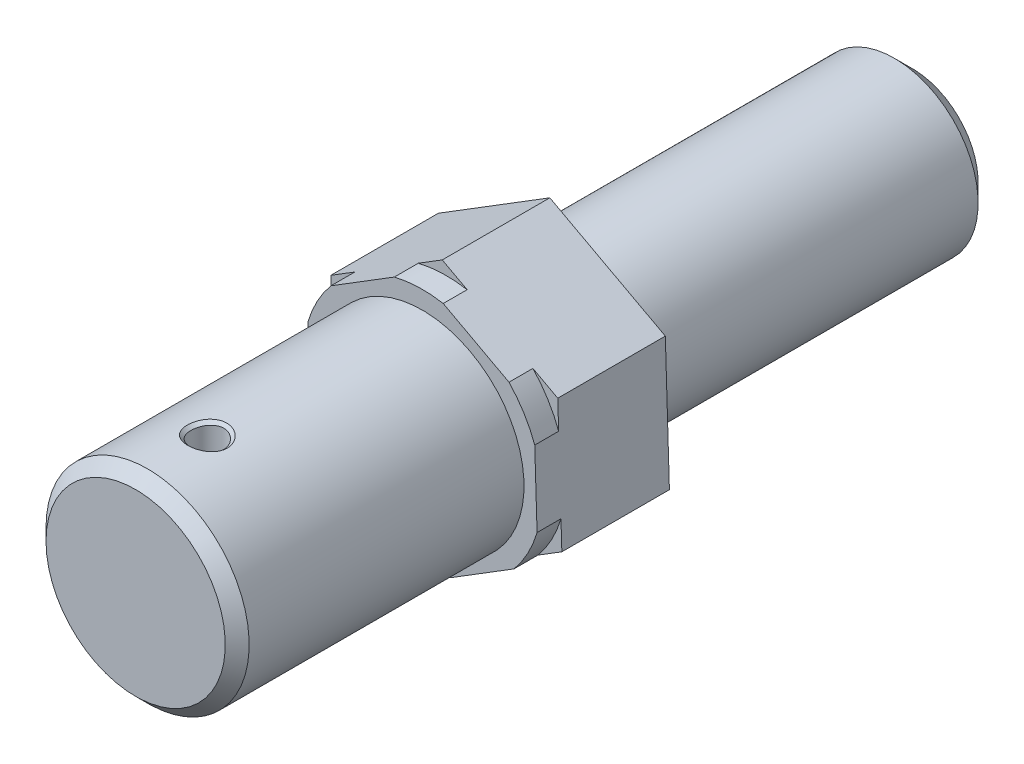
ISO-10303-21;
HEADER;
FILE_DESCRIPTION(('STEP AP214'),'2;1');
FILE_NAME('part.step','',(''),(''),'','','');
FILE_SCHEMA(('AUTOMOTIVE_DESIGN { 1 0 10303 214 1 1 1 1 }'));
ENDSEC;
DATA;
#1=APPLICATION_CONTEXT('core data for automotive mechanical design processes');
#2=APPLICATION_PROTOCOL_DEFINITION('international standard','automotive_design',2000,#1);
#3=PRODUCT_CONTEXT('',#1,'mechanical');
#4=PRODUCT('Part','Part','',(#3));
#5=PRODUCT_RELATED_PRODUCT_CATEGORY('part','',(#4));
#6=PRODUCT_DEFINITION_FORMATION('','',#4);
#7=PRODUCT_DEFINITION_CONTEXT('part definition',#1,'design');
#8=PRODUCT_DEFINITION('design','',#6,#7);
#9=PRODUCT_DEFINITION_SHAPE('','',#8);
#10=(LENGTH_UNIT() NAMED_UNIT(*) SI_UNIT(.MILLI.,.METRE.));
#11=(NAMED_UNIT(*) PLANE_ANGLE_UNIT() SI_UNIT($,.RADIAN.));
#12=(NAMED_UNIT(*) SI_UNIT($,.STERADIAN.) SOLID_ANGLE_UNIT());
#13=UNCERTAINTY_MEASURE_WITH_UNIT(LENGTH_MEASURE(1.E-05),#10,'distance_accuracy_value','');
#14=(GEOMETRIC_REPRESENTATION_CONTEXT(3) GLOBAL_UNCERTAINTY_ASSIGNED_CONTEXT((#13)) GLOBAL_UNIT_ASSIGNED_CONTEXT((#10,
#11,#12)) REPRESENTATION_CONTEXT('',''));
#15=CARTESIAN_POINT('',(0.,0.,0.));
#16=DIRECTION('',(0.,0.,1.));
#17=DIRECTION('',(1.,0.,0.));
#18=AXIS2_PLACEMENT_3D('',#15,#16,#17);
#19=CARTESIAN_POINT('',(-8.98353639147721,-16.7420450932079,0.));
#20=DIRECTION('',(0.,0.,-1.));
#21=DIRECTION('',(-1.,0.,0.));
#22=AXIS2_PLACEMENT_3D('',#19,#20,#21);
#23=PLANE('',#22);
#24=DIRECTION('',(0.850052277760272,0.526698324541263,0.));
#25=VECTOR('',#24,1.);
#26=CARTESIAN_POINT('',(0.341243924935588,-10.964346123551,0.));
#27=LINE('',#26,#25);
#28=CARTESIAN_POINT('',(0.341243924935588,-10.964346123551,0.));
#29=VERTEX_POINT('',#28);
#30=CARTESIAN_POINT('',(9.6660242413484,-5.18664715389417,0.));
#31=VERTEX_POINT('',#30);
#32=EDGE_CURVE('E247',#29,#31,#27,.T.);
#33=ORIENTED_EDGE('',*,*,#32,.F.);
#34=DIRECTION('',(0.881160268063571,-0.47281770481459,0.));
#35=VECTOR('',#34,1.);
#36=CARTESIAN_POINT('',(-9.32478031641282,-5.77769896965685,0.));
#37=LINE('',#36,#35);
#38=CARTESIAN_POINT('',(-9.32478031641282,-5.77769896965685,0.));
#39=VERTEX_POINT('',#38);
#40=EDGE_CURVE('E261',#39,#29,#37,.T.);
#41=ORIENTED_EDGE('',*,*,#40,.F.);
#42=DIRECTION('',(0.0311079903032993,-0.999516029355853,0.));
#43=VECTOR('',#42,1.);
#44=CARTESIAN_POINT('',(-9.66602424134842,5.18664715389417,0.));
#45=LINE('',#44,#43);
#46=CARTESIAN_POINT('',(-9.66602424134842,5.18664715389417,0.));
#47=VERTEX_POINT('',#46);
#48=EDGE_CURVE('E258',#47,#39,#45,.T.);
#49=ORIENTED_EDGE('',*,*,#48,.F.);
#50=DIRECTION('',(-0.850052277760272,-0.526698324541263,0.));
#51=VECTOR('',#50,1.);
#52=CARTESIAN_POINT('',(-0.341243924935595,10.964346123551,0.));
#53=LINE('',#52,#51);
#54=CARTESIAN_POINT('',(-0.341243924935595,10.964346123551,0.));
#55=VERTEX_POINT('',#54);
#56=EDGE_CURVE('E255',#55,#47,#53,.T.);
#57=ORIENTED_EDGE('',*,*,#56,.F.);
#58=DIRECTION('',(-0.881160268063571,0.472817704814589,0.));
#59=VECTOR('',#58,1.);
#60=CARTESIAN_POINT('',(9.3247803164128,5.77769896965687,0.));
#61=LINE('',#60,#59);
#62=CARTESIAN_POINT('',(9.3247803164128,5.77769896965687,0.));
#63=VERTEX_POINT('',#62);
#64=EDGE_CURVE('E252',#63,#55,#61,.T.);
#65=ORIENTED_EDGE('',*,*,#64,.F.);
#66=DIRECTION('',(-0.031107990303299,0.999516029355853,0.));
#67=VECTOR('',#66,1.);
#68=CARTESIAN_POINT('',(9.6660242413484,-5.18664715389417,0.));
#69=LINE('',#68,#67);
#70=EDGE_CURVE('E249',#31,#63,#69,.T.);
#71=ORIENTED_EDGE('',*,*,#70,.F.);
#72=EDGE_LOOP('',(#33,#41,#49,#57,#65,#71));
#73=FACE_BOUND('',#72,.T.);
#74=CARTESIAN_POINT('',(0.,0.,0.));
#75=DIRECTION('',(0.,0.,-1.));
#76=DIRECTION('',(-1.,0.,0.));
#77=AXIS2_PLACEMENT_3D('',#74,#75,#76);
#78=CIRCLE('',#77,7.);
#79=CARTESIAN_POINT('',(-7.,0.,0.));
#80=VERTEX_POINT('',#79);
#81=EDGE_CURVE('E443',#80,#80,#78,.T.);
#82=ORIENTED_EDGE('',*,*,#81,.F.);
#83=EDGE_LOOP('',(#82));
#84=FACE_BOUND('',#83,.T.);
#85=ADVANCED_FACE('F35',(#73,#84),#23,.T.);
#86=CARTESIAN_POINT('',(0.341243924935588,-10.964346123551,35.));
#87=DIRECTION('',(-0.526698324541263,0.850052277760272,0.));
#88=DIRECTION('',(-0.850052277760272,-0.526698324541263,0.));
#89=AXIS2_PLACEMENT_3D('',#86,#87,#88);
#90=PLANE('',#89);
#91=DIRECTION('',(0.,0.,-1.));
#92=VECTOR('',#91,1.);
#93=CARTESIAN_POINT('',(9.6660242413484,-5.18664715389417,35.));
#94=LINE('',#93,#92);
#95=CARTESIAN_POINT('',(9.6660242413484,-5.18664715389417,9.));
#96=VERTEX_POINT('',#95);
#97=EDGE_CURVE('E272',#96,#31,#94,.T.);
#98=ORIENTED_EDGE('',*,*,#97,.F.);
#99=DIRECTION('',(-0.850052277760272,-0.526698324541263,0.));
#100=VECTOR('',#99,1.);
#101=CARTESIAN_POINT('',(0.341243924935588,-10.964346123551,9.));
#102=LINE('',#101,#100);
#103=CARTESIAN_POINT('',(7.65792146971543,-6.43088164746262,9.));
#104=VERTEX_POINT('',#103);
#105=EDGE_CURVE('E234',#96,#104,#102,.T.);
#106=ORIENTED_EDGE('',*,*,#105,.T.);
#107=DIRECTION('',(0.,0.,-1.));
#108=VECTOR('',#107,1.);
#109=CARTESIAN_POINT('',(7.65792146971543,-6.43088164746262,-1.49320206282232));
#110=LINE('',#109,#108);
#111=CARTESIAN_POINT('',(7.65792146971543,-6.43088164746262,11.));
#112=VERTEX_POINT('',#111);
#113=EDGE_CURVE('E226',#104,#112,#110,.F.);
#114=ORIENTED_EDGE('',*,*,#113,.T.);
#115=DIRECTION('',(-0.850052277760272,-0.526698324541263,0.));
#116=VECTOR('',#115,1.);
#117=CARTESIAN_POINT('',(0.341243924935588,-10.964346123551,11.));
#118=LINE('',#117,#116);
#119=CARTESIAN_POINT('',(2.34934669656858,-9.72011162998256,11.));
#120=VERTEX_POINT('',#119);
#121=EDGE_CURVE('E177',#112,#120,#118,.T.);
#122=ORIENTED_EDGE('',*,*,#121,.T.);
#123=DIRECTION('',(0.,0.,-1.));
#124=VECTOR('',#123,1.);
#125=CARTESIAN_POINT('',(2.34934669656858,-9.72011162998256,-1.49320206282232));
#126=LINE('',#125,#124);
#127=CARTESIAN_POINT('',(2.34934669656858,-9.72011162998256,9.));
#128=VERTEX_POINT('',#127);
#129=EDGE_CURVE('E223',#120,#128,#126,.T.);
#130=ORIENTED_EDGE('',*,*,#129,.T.);
#131=CARTESIAN_POINT('',(0.341243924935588,-10.964346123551,9.));
#132=VERTEX_POINT('',#131);
#133=EDGE_CURVE('E231',#128,#132,#102,.T.);
#134=ORIENTED_EDGE('',*,*,#133,.T.);
#135=DIRECTION('',(0.,0.,-1.));
#136=VECTOR('',#135,1.);
#137=CARTESIAN_POINT('',(0.341243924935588,-10.964346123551,35.));
#138=LINE('',#137,#136);
#139=EDGE_CURVE('E61',#132,#29,#138,.T.);
#140=ORIENTED_EDGE('',*,*,#139,.T.);
#141=ORIENTED_EDGE('',*,*,#32,.T.);
#142=EDGE_LOOP('',(#98,#106,#114,#122,#130,#134,#140,#141));
#143=FACE_BOUND('',#142,.T.);
#144=ADVANCED_FACE('F37',(#143),#90,.F.);
#145=CARTESIAN_POINT('',(9.6660242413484,-5.18664715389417,35.));
#146=DIRECTION('',(-0.999516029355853,-0.031107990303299,0.));
#147=DIRECTION('',(0.031107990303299,-0.999516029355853,0.));
#148=AXIS2_PLACEMENT_3D('',#145,#146,#147);
#149=PLANE('',#148);
#150=DIRECTION('',(0.,0.,-1.));
#151=VECTOR('',#150,1.);
#152=CARTESIAN_POINT('',(9.3247803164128,5.77769896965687,35.));
#153=LINE('',#152,#151);
#154=CARTESIAN_POINT('',(9.3247803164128,5.77769896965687,9.));
#155=VERTEX_POINT('',#154);
#156=EDGE_CURVE('E270',#155,#63,#153,.T.);
#157=ORIENTED_EDGE('',*,*,#156,.F.);
#158=DIRECTION('',(0.031107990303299,-0.999516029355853,0.));
#159=VECTOR('',#158,1.);
#160=CARTESIAN_POINT('',(9.6660242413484,-5.18664715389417,9.));
#161=LINE('',#160,#159);
#162=CARTESIAN_POINT('',(9.39826761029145,3.41651370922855,9.));
#163=VERTEX_POINT('',#162);
#164=EDGE_CURVE('E243',#155,#163,#161,.T.);
#165=ORIENTED_EDGE('',*,*,#164,.T.);
#166=DIRECTION('',(0.,0.,-1.));
#167=VECTOR('',#166,1.);
#168=CARTESIAN_POINT('',(9.39826761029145,3.41651370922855,-1.49320206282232));
#169=LINE('',#168,#167);
#170=CARTESIAN_POINT('',(9.39826761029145,3.41651370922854,11.));
#171=VERTEX_POINT('',#170);
#172=EDGE_CURVE('E220',#163,#171,#169,.F.);
#173=ORIENTED_EDGE('',*,*,#172,.T.);
#174=DIRECTION('',(0.031107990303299,-0.999516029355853,0.));
#175=VECTOR('',#174,1.);
#176=CARTESIAN_POINT('',(9.6660242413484,-5.18664715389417,11.));
#177=LINE('',#176,#175);
#178=CARTESIAN_POINT('',(9.59253694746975,-2.82546189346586,11.));
#179=VERTEX_POINT('',#178);
#180=EDGE_CURVE('E200',#171,#179,#177,.T.);
#181=ORIENTED_EDGE('',*,*,#180,.T.);
#182=DIRECTION('',(0.,0.,-1.));
#183=VECTOR('',#182,1.);
#184=CARTESIAN_POINT('',(9.59253694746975,-2.82546189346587,-1.49320206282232));
#185=LINE('',#184,#183);
#186=CARTESIAN_POINT('',(9.59253694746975,-2.82546189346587,9.));
#187=VERTEX_POINT('',#186);
#188=EDGE_CURVE('E217',#179,#187,#185,.T.);
#189=ORIENTED_EDGE('',*,*,#188,.T.);
#190=EDGE_CURVE('E246',#187,#96,#161,.T.);
#191=ORIENTED_EDGE('',*,*,#190,.T.);
#192=ORIENTED_EDGE('',*,*,#97,.T.);
#193=ORIENTED_EDGE('',*,*,#70,.T.);
#194=EDGE_LOOP('',(#157,#165,#173,#181,#189,#191,#192,#193));
#195=FACE_BOUND('',#194,.T.);
#196=ADVANCED_FACE('F378',(#195),#149,.F.);
#197=CARTESIAN_POINT('',(9.3247803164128,5.77769896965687,35.));
#198=DIRECTION('',(-0.472817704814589,-0.881160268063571,0.));
#199=DIRECTION('',(0.881160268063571,-0.472817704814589,0.));
#200=AXIS2_PLACEMENT_3D('',#197,#198,#199);
#201=PLANE('',#200);
#202=DIRECTION('',(0.,0.,-1.));
#203=VECTOR('',#202,1.);
#204=CARTESIAN_POINT('',(-0.341243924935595,10.964346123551,35.));
#205=LINE('',#204,#203);
#206=CARTESIAN_POINT('',(-0.341243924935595,10.964346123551,9.));
#207=VERTEX_POINT('',#206);
#208=EDGE_CURVE('E268',#207,#55,#205,.T.);
#209=ORIENTED_EDGE('',*,*,#208,.F.);
#210=DIRECTION('',(0.881160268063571,-0.472817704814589,0.));
#211=VECTOR('',#210,1.);
#212=CARTESIAN_POINT('',(9.3247803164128,5.77769896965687,9.));
#213=LINE('',#212,#211);
#214=CARTESIAN_POINT('',(1.74034614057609,9.84739535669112,9.));
#215=VERTEX_POINT('',#214);
#216=EDGE_CURVE('E239',#207,#215,#213,.T.);
#217=ORIENTED_EDGE('',*,*,#216,.T.);
#218=DIRECTION('',(0.,0.,-1.));
#219=VECTOR('',#218,1.);
#220=CARTESIAN_POINT('',(1.74034614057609,9.84739535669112,-1.49320206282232));
#221=LINE('',#220,#219);
#222=CARTESIAN_POINT('',(1.74034614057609,9.84739535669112,11.));
#223=VERTEX_POINT('',#222);
#224=EDGE_CURVE('E214',#215,#223,#221,.F.);
#225=ORIENTED_EDGE('',*,*,#224,.T.);
#226=DIRECTION('',(0.881160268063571,-0.472817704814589,0.));
#227=VECTOR('',#226,1.);
#228=CARTESIAN_POINT('',(9.3247803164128,5.77769896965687,11.));
#229=LINE('',#228,#227);
#230=CARTESIAN_POINT('',(7.24319025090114,6.89464973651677,11.));
#231=VERTEX_POINT('',#230);
#232=EDGE_CURVE('E193',#223,#231,#229,.T.);
#233=ORIENTED_EDGE('',*,*,#232,.T.);
#234=DIRECTION('',(0.,0.,-1.));
#235=VECTOR('',#234,1.);
#236=CARTESIAN_POINT('',(7.24319025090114,6.89464973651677,-1.49320206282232));
#237=LINE('',#236,#235);
#238=CARTESIAN_POINT('',(7.24319025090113,6.89464973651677,9.));
#239=VERTEX_POINT('',#238);
#240=EDGE_CURVE('E211',#231,#239,#237,.T.);
#241=ORIENTED_EDGE('',*,*,#240,.T.);
#242=EDGE_CURVE('E242',#239,#155,#213,.T.);
#243=ORIENTED_EDGE('',*,*,#242,.T.);
#244=ORIENTED_EDGE('',*,*,#156,.T.);
#245=ORIENTED_EDGE('',*,*,#64,.T.);
#246=EDGE_LOOP('',(#209,#217,#225,#233,#241,#243,#244,#245));
#247=FACE_BOUND('',#246,.T.);
#248=ADVANCED_FACE('F396',(#247),#201,.F.);
#249=CARTESIAN_POINT('',(-0.341243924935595,10.964346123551,35.));
#250=DIRECTION('',(0.526698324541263,-0.850052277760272,0.));
#251=DIRECTION('',(0.850052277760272,0.526698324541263,0.));
#252=AXIS2_PLACEMENT_3D('',#249,#250,#251);
#253=PLANE('',#252);
#254=DIRECTION('',(0.,0.,-1.));
#255=VECTOR('',#254,1.);
#256=CARTESIAN_POINT('',(-9.66602424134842,5.18664715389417,35.));
#257=LINE('',#256,#255);
#258=CARTESIAN_POINT('',(-9.66602424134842,5.18664715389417,9.));
#259=VERTEX_POINT('',#258);
#260=EDGE_CURVE('E266',#259,#47,#257,.T.);
#261=ORIENTED_EDGE('',*,*,#260,.F.);
#262=DIRECTION('',(0.850052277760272,0.526698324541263,0.));
#263=VECTOR('',#262,1.);
#264=CARTESIAN_POINT('',(-0.341243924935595,10.964346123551,9.));
#265=LINE('',#264,#263);
#266=CARTESIAN_POINT('',(-7.6579214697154,6.43088164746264,9.));
#267=VERTEX_POINT('',#266);
#268=EDGE_CURVE('E235',#259,#267,#265,.T.);
#269=ORIENTED_EDGE('',*,*,#268,.T.);
#270=DIRECTION('',(0.,0.,-1.));
#271=VECTOR('',#270,1.);
#272=CARTESIAN_POINT('',(-7.6579214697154,6.43088164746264,-1.49320206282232));
#273=LINE('',#272,#271);
#274=CARTESIAN_POINT('',(-7.6579214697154,6.43088164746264,11.));
#275=VERTEX_POINT('',#274);
#276=EDGE_CURVE('E209',#267,#275,#273,.F.);
#277=ORIENTED_EDGE('',*,*,#276,.T.);
#278=DIRECTION('',(0.850052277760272,0.526698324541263,0.));
#279=VECTOR('',#278,1.);
#280=CARTESIAN_POINT('',(-0.341243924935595,10.964346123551,11.));
#281=LINE('',#280,#279);
#282=CARTESIAN_POINT('',(-2.34934669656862,9.72011162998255,11.));
#283=VERTEX_POINT('',#282);
#284=EDGE_CURVE('E184',#275,#283,#281,.T.);
#285=ORIENTED_EDGE('',*,*,#284,.T.);
#286=DIRECTION('',(0.,0.,-1.));
#287=VECTOR('',#286,1.);
#288=CARTESIAN_POINT('',(-2.34934669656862,9.72011162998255,-1.49320206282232));
#289=LINE('',#288,#287);
#290=CARTESIAN_POINT('',(-2.34934669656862,9.72011162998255,9.));
#291=VERTEX_POINT('',#290);
#292=EDGE_CURVE('E206',#283,#291,#289,.T.);
#293=ORIENTED_EDGE('',*,*,#292,.T.);
#294=EDGE_CURVE('E238',#291,#207,#265,.T.);
#295=ORIENTED_EDGE('',*,*,#294,.T.);
#296=ORIENTED_EDGE('',*,*,#208,.T.);
#297=ORIENTED_EDGE('',*,*,#56,.T.);
#298=EDGE_LOOP('',(#261,#269,#277,#285,#293,#295,#296,#297));
#299=FACE_BOUND('',#298,.T.);
#300=ADVANCED_FACE('F393',(#299),#253,.F.);
#301=CARTESIAN_POINT('',(-9.66602424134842,5.18664715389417,35.));
#302=DIRECTION('',(0.999516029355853,0.0311079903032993,0.));
#303=DIRECTION('',(-0.0311079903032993,0.999516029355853,0.));
#304=AXIS2_PLACEMENT_3D('',#301,#302,#303);
#305=PLANE('',#304);
#306=DIRECTION('',(0.,0.,-1.));
#307=VECTOR('',#306,1.);
#308=CARTESIAN_POINT('',(-9.32478031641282,-5.77769896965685,35.));
#309=LINE('',#308,#307);
#310=CARTESIAN_POINT('',(-9.32478031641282,-5.77769896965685,9.));
#311=VERTEX_POINT('',#310);
#312=EDGE_CURVE('E264',#311,#39,#309,.T.);
#313=ORIENTED_EDGE('',*,*,#312,.F.);
#314=DIRECTION('',(-0.0311079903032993,0.999516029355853,0.));
#315=VECTOR('',#314,1.);
#316=CARTESIAN_POINT('',(-9.66602424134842,5.18664715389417,9.));
#317=LINE('',#316,#315);
#318=CARTESIAN_POINT('',(-9.39826761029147,-3.41651370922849,9.));
#319=VERTEX_POINT('',#318);
#320=EDGE_CURVE('E229',#311,#319,#317,.T.);
#321=ORIENTED_EDGE('',*,*,#320,.T.);
#322=DIRECTION('',(0.,0.,-1.));
#323=VECTOR('',#322,1.);
#324=CARTESIAN_POINT('',(-9.39826761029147,-3.41651370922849,-1.49320206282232));
#325=LINE('',#324,#323);
#326=CARTESIAN_POINT('',(-9.39826761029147,-3.41651370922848,11.));
#327=VERTEX_POINT('',#326);
#328=EDGE_CURVE('E176',#319,#327,#325,.F.);
#329=ORIENTED_EDGE('',*,*,#328,.T.);
#330=DIRECTION('',(-0.0311079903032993,0.999516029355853,0.));
#331=VECTOR('',#330,1.);
#332=CARTESIAN_POINT('',(-9.66602424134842,5.18664715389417,11.));
#333=LINE('',#332,#331);
#334=CARTESIAN_POINT('',(-9.59253694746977,2.82546189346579,11.));
#335=VERTEX_POINT('',#334);
#336=EDGE_CURVE('E181',#327,#335,#333,.T.);
#337=ORIENTED_EDGE('',*,*,#336,.T.);
#338=DIRECTION('',(0.,0.,-1.));
#339=VECTOR('',#338,1.);
#340=CARTESIAN_POINT('',(-9.59253694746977,2.8254618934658,-1.49320206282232));
#341=LINE('',#340,#339);
#342=CARTESIAN_POINT('',(-9.59253694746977,2.82546189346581,9.));
#343=VERTEX_POINT('',#342);
#344=EDGE_CURVE('E166',#335,#343,#341,.T.);
#345=ORIENTED_EDGE('',*,*,#344,.T.);
#346=EDGE_CURVE('E232',#343,#259,#317,.T.);
#347=ORIENTED_EDGE('',*,*,#346,.T.);
#348=ORIENTED_EDGE('',*,*,#260,.T.);
#349=ORIENTED_EDGE('',*,*,#48,.T.);
#350=EDGE_LOOP('',(#313,#321,#329,#337,#345,#347,#348,#349));
#351=FACE_BOUND('',#350,.T.);
#352=ADVANCED_FACE('F190',(#351),#305,.F.);
#353=CARTESIAN_POINT('',(-9.32478031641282,-5.77769896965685,35.));
#354=DIRECTION('',(0.472817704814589,0.881160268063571,0.));
#355=DIRECTION('',(-0.881160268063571,0.47281770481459,0.));
#356=AXIS2_PLACEMENT_3D('',#353,#354,#355);
#357=PLANE('',#356);
#358=ORIENTED_EDGE('',*,*,#139,.F.);
#359=DIRECTION('',(-0.881160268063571,0.47281770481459,0.));
#360=VECTOR('',#359,1.);
#361=CARTESIAN_POINT('',(-9.32478031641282,-5.77769896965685,9.));
#362=LINE('',#361,#360);
#363=CARTESIAN_POINT('',(-1.74034614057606,-9.84739535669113,9.));
#364=VERTEX_POINT('',#363);
#365=EDGE_CURVE('E286',#132,#364,#362,.T.);
#366=ORIENTED_EDGE('',*,*,#365,.T.);
#367=DIRECTION('',(0.,0.,-1.));
#368=VECTOR('',#367,1.);
#369=CARTESIAN_POINT('',(-1.74034614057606,-9.84739535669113,-1.49320206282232));
#370=LINE('',#369,#368);
#371=CARTESIAN_POINT('',(-1.74034614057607,-9.84739535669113,11.));
#372=VERTEX_POINT('',#371);
#373=EDGE_CURVE('E280',#364,#372,#370,.F.);
#374=ORIENTED_EDGE('',*,*,#373,.T.);
#375=DIRECTION('',(-0.881160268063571,0.47281770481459,0.));
#376=VECTOR('',#375,1.);
#377=CARTESIAN_POINT('',(-9.32478031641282,-5.77769896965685,11.));
#378=LINE('',#377,#376);
#379=CARTESIAN_POINT('',(-7.24319025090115,-6.89464973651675,11.));
#380=VERTEX_POINT('',#379);
#381=EDGE_CURVE('E274',#372,#380,#378,.T.);
#382=ORIENTED_EDGE('',*,*,#381,.T.);
#383=DIRECTION('',(0.,0.,-1.));
#384=VECTOR('',#383,1.);
#385=CARTESIAN_POINT('',(-7.24319025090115,-6.89464973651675,-1.49320206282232));
#386=LINE('',#385,#384);
#387=CARTESIAN_POINT('',(-7.24319025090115,-6.89464973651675,9.));
#388=VERTEX_POINT('',#387);
#389=EDGE_CURVE('E277',#380,#388,#386,.T.);
#390=ORIENTED_EDGE('',*,*,#389,.T.);
#391=EDGE_CURVE('E283',#388,#311,#362,.T.);
#392=ORIENTED_EDGE('',*,*,#391,.T.);
#393=ORIENTED_EDGE('',*,*,#312,.T.);
#394=ORIENTED_EDGE('',*,*,#40,.T.);
#395=EDGE_LOOP('',(#358,#366,#374,#382,#390,#392,#393,#394));
#396=FACE_BOUND('',#395,.T.);
#397=ADVANCED_FACE('F387',(#396),#357,.F.);
#398=CARTESIAN_POINT('',(0.,13.0860290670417,9.));
#399=DIRECTION('',(0.,0.,-1.));
#400=DIRECTION('',(-1.,0.,0.));
#401=AXIS2_PLACEMENT_3D('',#398,#399,#400);
#402=PLANE('',#401);
#403=ORIENTED_EDGE('',*,*,#190,.F.);
#404=CARTESIAN_POINT('',(0.,0.,9.));
#405=DIRECTION('',(0.,0.,-1.));
#406=DIRECTION('',(-1.,0.,0.));
#407=AXIS2_PLACEMENT_3D('',#404,#405,#406);
#408=CIRCLE('',#407,10.);
#409=EDGE_CURVE('E419',#187,#104,#408,.T.);
#410=ORIENTED_EDGE('',*,*,#409,.T.);
#411=ORIENTED_EDGE('',*,*,#105,.F.);
#412=EDGE_LOOP('',(#403,#410,#411));
#413=FACE_BOUND('',#412,.T.);
#414=ADVANCED_FACE('F383',(#413),#402,.F.);
#415=ORIENTED_EDGE('',*,*,#242,.F.);
#416=EDGE_CURVE('E414',#239,#163,#408,.T.);
#417=ORIENTED_EDGE('',*,*,#416,.T.);
#418=ORIENTED_EDGE('',*,*,#164,.F.);
#419=EDGE_LOOP('',(#415,#417,#418));
#420=FACE_BOUND('',#419,.T.);
#421=ADVANCED_FACE('F413',(#420),#402,.F.);
#422=ORIENTED_EDGE('',*,*,#294,.F.);
#423=EDGE_CURVE('E195',#291,#215,#408,.T.);
#424=ORIENTED_EDGE('',*,*,#423,.T.);
#425=ORIENTED_EDGE('',*,*,#216,.F.);
#426=EDGE_LOOP('',(#422,#424,#425));
#427=FACE_BOUND('',#426,.T.);
#428=ADVANCED_FACE('F533',(#427),#402,.F.);
#429=ORIENTED_EDGE('',*,*,#346,.F.);
#430=EDGE_CURVE('E172',#343,#267,#408,.T.);
#431=ORIENTED_EDGE('',*,*,#430,.T.);
#432=ORIENTED_EDGE('',*,*,#268,.F.);
#433=EDGE_LOOP('',(#429,#431,#432));
#434=FACE_BOUND('',#433,.T.);
#435=ADVANCED_FACE('F537',(#434),#402,.F.);
#436=EDGE_CURVE('E422',#128,#364,#408,.T.);
#437=ORIENTED_EDGE('',*,*,#436,.T.);
#438=ORIENTED_EDGE('',*,*,#365,.F.);
#439=ORIENTED_EDGE('',*,*,#133,.F.);
#440=EDGE_LOOP('',(#437,#438,#439));
#441=FACE_BOUND('',#440,.T.);
#442=ADVANCED_FACE('F523',(#441),#402,.F.);
#443=ORIENTED_EDGE('',*,*,#391,.F.);
#444=EDGE_CURVE('E185',#388,#319,#408,.T.);
#445=ORIENTED_EDGE('',*,*,#444,.T.);
#446=ORIENTED_EDGE('',*,*,#320,.F.);
#447=EDGE_LOOP('',(#443,#445,#446));
#448=FACE_BOUND('',#447,.T.);
#449=ADVANCED_FACE('F433',(#448),#402,.F.);
#450=CARTESIAN_POINT('',(0.,0.,-1.49320206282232));
#451=DIRECTION('',(0.,0.,-1.));
#452=DIRECTION('',(-1.,0.,0.));
#453=AXIS2_PLACEMENT_3D('',#450,#451,#452);
#454=CYLINDRICAL_SURFACE('',#453,10.);
#455=ORIENTED_EDGE('',*,*,#409,.F.);
#456=ORIENTED_EDGE('',*,*,#188,.F.);
#457=CARTESIAN_POINT('',(0.,0.,11.));
#458=DIRECTION('',(0.,0.,-1.));
#459=DIRECTION('',(-1.,0.,0.));
#460=AXIS2_PLACEMENT_3D('',#457,#458,#459);
#461=CIRCLE('',#460,10.);
#462=EDGE_CURVE('E441',#179,#112,#461,.T.);
#463=ORIENTED_EDGE('',*,*,#462,.T.);
#464=ORIENTED_EDGE('',*,*,#113,.F.);
#465=EDGE_LOOP('',(#455,#456,#463,#464));
#466=FACE_BOUND('',#465,.T.);
#467=ADVANCED_FACE('F510',(#466),#454,.T.);
#468=EDGE_CURVE('E438',#120,#372,#461,.T.);
#469=ORIENTED_EDGE('',*,*,#468,.T.);
#470=ORIENTED_EDGE('',*,*,#373,.F.);
#471=ORIENTED_EDGE('',*,*,#436,.F.);
#472=ORIENTED_EDGE('',*,*,#129,.F.);
#473=EDGE_LOOP('',(#469,#470,#471,#472));
#474=FACE_BOUND('',#473,.T.);
#475=ADVANCED_FACE('F516',(#474),#454,.T.);
#476=ORIENTED_EDGE('',*,*,#416,.F.);
#477=ORIENTED_EDGE('',*,*,#240,.F.);
#478=EDGE_CURVE('E527',#231,#171,#461,.T.);
#479=ORIENTED_EDGE('',*,*,#478,.T.);
#480=ORIENTED_EDGE('',*,*,#172,.F.);
#481=EDGE_LOOP('',(#476,#477,#479,#480));
#482=FACE_BOUND('',#481,.T.);
#483=ADVANCED_FACE('F416',(#482),#454,.T.);
#484=ORIENTED_EDGE('',*,*,#423,.F.);
#485=ORIENTED_EDGE('',*,*,#292,.F.);
#486=EDGE_CURVE('E186',#283,#223,#461,.T.);
#487=ORIENTED_EDGE('',*,*,#486,.T.);
#488=ORIENTED_EDGE('',*,*,#224,.F.);
#489=EDGE_LOOP('',(#484,#485,#487,#488));
#490=FACE_BOUND('',#489,.T.);
#491=ADVANCED_FACE('F514',(#490),#454,.T.);
#492=ORIENTED_EDGE('',*,*,#430,.F.);
#493=ORIENTED_EDGE('',*,*,#344,.F.);
#494=EDGE_CURVE('E169',#335,#275,#461,.T.);
#495=ORIENTED_EDGE('',*,*,#494,.T.);
#496=ORIENTED_EDGE('',*,*,#276,.F.);
#497=EDGE_LOOP('',(#492,#493,#495,#496));
#498=FACE_BOUND('',#497,.T.);
#499=ADVANCED_FACE('F168',(#498),#454,.T.);
#500=ORIENTED_EDGE('',*,*,#444,.F.);
#501=ORIENTED_EDGE('',*,*,#389,.F.);
#502=EDGE_CURVE('E53',#380,#327,#461,.T.);
#503=ORIENTED_EDGE('',*,*,#502,.T.);
#504=ORIENTED_EDGE('',*,*,#328,.F.);
#505=EDGE_LOOP('',(#500,#501,#503,#504));
#506=FACE_BOUND('',#505,.T.);
#507=ADVANCED_FACE('F437',(#506),#454,.T.);
#508=CARTESIAN_POINT('',(0.,10.,11.));
#509=DIRECTION('',(0.,0.,-1.));
#510=DIRECTION('',(-1.,0.,0.));
#511=AXIS2_PLACEMENT_3D('',#508,#509,#510);
#512=PLANE('',#511);
#513=CARTESIAN_POINT('',(0.,0.,11.));
#514=DIRECTION('',(0.,0.,-1.));
#515=DIRECTION('',(-1.,0.,0.));
#516=AXIS2_PLACEMENT_3D('',#513,#514,#515);
#517=CIRCLE('',#516,8.5);
#518=CARTESIAN_POINT('',(-8.5,0.,11.));
#519=VERTEX_POINT('',#518);
#520=EDGE_CURVE('E439',#519,#519,#517,.T.);
#521=ORIENTED_EDGE('',*,*,#520,.T.);
#522=EDGE_LOOP('',(#521));
#523=FACE_BOUND('',#522,.T.);
#524=ORIENTED_EDGE('',*,*,#462,.F.);
#525=ORIENTED_EDGE('',*,*,#180,.F.);
#526=ORIENTED_EDGE('',*,*,#478,.F.);
#527=ORIENTED_EDGE('',*,*,#232,.F.);
#528=ORIENTED_EDGE('',*,*,#486,.F.);
#529=ORIENTED_EDGE('',*,*,#284,.F.);
#530=ORIENTED_EDGE('',*,*,#494,.F.);
#531=ORIENTED_EDGE('',*,*,#336,.F.);
#532=ORIENTED_EDGE('',*,*,#502,.F.);
#533=ORIENTED_EDGE('',*,*,#381,.F.);
#534=ORIENTED_EDGE('',*,*,#468,.F.);
#535=ORIENTED_EDGE('',*,*,#121,.F.);
#536=EDGE_LOOP('',(#524,#525,#526,#527,#528,#529,#530,#531,#532,#533,#534,#535));
#537=FACE_BOUND('',#536,.T.);
#538=ADVANCED_FACE('F180',(#523,#537),#512,.F.);
#539=CARTESIAN_POINT('',(0.,0.,-1.49320206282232));
#540=DIRECTION('',(0.,0.,-1.));
#541=DIRECTION('',(-1.,0.,0.));
#542=AXIS2_PLACEMENT_3D('',#539,#540,#541);
#543=CYLINDRICAL_SURFACE('',#542,8.5);
#544=CARTESIAN_POINT('',(0.,-8.5,30.6249999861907));
#545=CARTESIAN_POINT('',(-0.0274901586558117,-8.50000357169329,30.6250212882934));
#546=CARTESIAN_POINT('',(-0.0549797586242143,-8.49985669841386,30.6243561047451));
#547=CARTESIAN_POINT('',(-0.109849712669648,-8.49927748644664,30.6216750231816));
#548=CARTESIAN_POINT('',(-0.137230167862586,-8.49884556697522,30.6196611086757));
#549=CARTESIAN_POINT('',(-0.191823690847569,-8.49771225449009,30.6143078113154));
#550=CARTESIAN_POINT('',(-0.219036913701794,-8.4970111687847,30.6109699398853));
#551=CARTESIAN_POINT('',(-0.273238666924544,-8.49535561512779,30.6029943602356));
#552=CARTESIAN_POINT('',(-0.300227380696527,-8.49440138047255,30.5983578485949));
#553=CARTESIAN_POINT('',(-0.353922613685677,-8.49225554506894,30.5878103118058));
#554=CARTESIAN_POINT('',(-0.38062933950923,-8.49106413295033,30.5819002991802));
#555=CARTESIAN_POINT('',(-0.433703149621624,-8.48845994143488,30.5688309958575));
#556=CARTESIAN_POINT('',(-0.460070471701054,-8.48704732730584,30.5616726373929));
#557=CARTESIAN_POINT('',(-0.512407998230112,-8.48401670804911,30.5461317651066));
#558=CARTESIAN_POINT('',(-0.538378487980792,-8.48239885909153,30.5377501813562));
#559=CARTESIAN_POINT('',(-0.589864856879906,-8.47897373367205,30.5197879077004));
#560=CARTESIAN_POINT('',(-0.615381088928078,-8.47716661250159,30.5102081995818));
#561=CARTESIAN_POINT('',(-0.665901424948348,-8.47337890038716,30.4898746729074));
#562=CARTESIAN_POINT('',(-0.690905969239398,-8.471398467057,30.479121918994));
#563=CARTESIAN_POINT('',(-0.740345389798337,-8.4672800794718,30.4564672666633));
#564=CARTESIAN_POINT('',(-0.764780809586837,-8.46514228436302,30.4445665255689));
#565=CARTESIAN_POINT('',(-0.813024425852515,-8.46072514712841,30.4196408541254));
#566=CARTESIAN_POINT('',(-0.836833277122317,-8.45844596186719,30.4066171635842));
#567=CARTESIAN_POINT('',(-0.883766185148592,-8.45376193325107,30.3794705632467));
#568=CARTESIAN_POINT('',(-0.906891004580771,-8.45135723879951,30.3653489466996));
#569=CARTESIAN_POINT('',(-0.95239830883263,-8.44643841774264,30.3360314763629));
#570=CARTESIAN_POINT('',(-0.97478164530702,-8.44392442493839,30.3208369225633));
#571=CARTESIAN_POINT('',(-1.01874836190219,-8.43880200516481,30.2893986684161));
#572=CARTESIAN_POINT('',(-1.04033264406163,-8.4361936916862,30.2731562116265));
#573=CARTESIAN_POINT('',(-1.08264405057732,-8.43090223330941,30.2396470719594));
#574=CARTESIAN_POINT('',(-1.10337206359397,-8.42821917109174,30.2223814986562));
#575=CARTESIAN_POINT('',(-1.14391238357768,-8.42278068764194,30.186851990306));
#576=CARTESIAN_POINT('',(-1.16372547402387,-8.42002533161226,30.1685889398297));
#577=CARTESIAN_POINT('',(-1.20236746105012,-8.41451078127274,30.1311020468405));
#578=CARTESIAN_POINT('',(-1.22119766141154,-8.41175159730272,30.1118795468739));
#579=CARTESIAN_POINT('',(-1.25783494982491,-8.40629895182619,30.0725411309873));
#580=CARTESIAN_POINT('',(-1.27564385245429,-8.40360537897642,30.0524269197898));
#581=CARTESIAN_POINT('',(-1.3102111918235,-8.39828734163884,30.0113622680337));
#582=CARTESIAN_POINT('',(-1.32697126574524,-8.39566277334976,29.9904132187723));
#583=CARTESIAN_POINT('',(-1.3594149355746,-8.39050321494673,29.9477350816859));
#584=CARTESIAN_POINT('',(-1.37510004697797,-8.38796810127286,29.9260071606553));
#585=CARTESIAN_POINT('',(-1.40536734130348,-8.3830033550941,29.8818276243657));
#586=CARTESIAN_POINT('',(-1.41995096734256,-8.3805735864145,29.8593770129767));
#587=CARTESIAN_POINT('',(-1.44798888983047,-8.37583665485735,29.8138083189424));
#588=CARTESIAN_POINT('',(-1.46144459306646,-8.37352934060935,29.7906911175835));
#589=CARTESIAN_POINT('',(-1.48720020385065,-8.36905411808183,29.7438454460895));
#590=CARTESIAN_POINT('',(-1.49950150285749,-8.36688604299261,29.7201177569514));
#591=CARTESIAN_POINT('',(-1.5229218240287,-8.36270618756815,29.6721072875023));
#592=CARTESIAN_POINT('',(-1.53404222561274,-8.36069422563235,29.6478251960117));
#593=CARTESIAN_POINT('',(-1.5550742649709,-8.35684346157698,29.5987620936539));
#594=CARTESIAN_POINT('',(-1.56498725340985,-8.35500446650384,29.5739816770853));
#595=CARTESIAN_POINT('',(-1.58357799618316,-8.35151650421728,29.5239780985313));
#596=CARTESIAN_POINT('',(-1.59225703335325,-8.3498673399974,29.4987554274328));
#597=CARTESIAN_POINT('',(-1.60835344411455,-8.34677589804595,29.4479235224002));
#598=CARTESIAN_POINT('',(-1.61577196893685,-8.34533343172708,29.422314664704));
#599=CARTESIAN_POINT('',(-1.62932098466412,-8.34267223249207,29.3707665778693));
#600=CARTESIAN_POINT('',(-1.63545240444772,-8.34145333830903,29.3448276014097));
#601=CARTESIAN_POINT('',(-1.64640095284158,-8.33925610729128,29.2926754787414));
#602=CARTESIAN_POINT('',(-1.65121866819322,-8.33827766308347,29.2664624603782));
#603=CARTESIAN_POINT('',(-1.65951359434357,-8.33657813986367,29.2138184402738));
#604=CARTESIAN_POINT('',(-1.66299089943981,-8.33585704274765,29.1873874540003));
#605=CARTESIAN_POINT('',(-1.6685792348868,-8.3346889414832,29.1343637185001));
#606=CARTESIAN_POINT('',(-1.67068968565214,-8.33424205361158,29.1077709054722));
#607=CARTESIAN_POINT('',(-1.67351764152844,-8.33363921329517,29.0544795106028));
#608=CARTESIAN_POINT('',(-1.67423368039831,-8.33348356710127,29.0277808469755));
#609=CARTESIAN_POINT('',(-1.67425039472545,-8.33347939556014,28.9743832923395));
#610=CARTESIAN_POINT('',(-1.67355107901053,-8.33363086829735,28.9476844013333));
#611=CARTESIAN_POINT('',(-1.67076230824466,-8.33422456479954,28.8943917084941));
#612=CARTESIAN_POINT('',(-1.6686743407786,-8.33466647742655,28.8677978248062));
#613=CARTESIAN_POINT('',(-1.66313444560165,-8.33582421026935,28.8147709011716));
#614=CARTESIAN_POINT('',(-1.65968313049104,-8.33653990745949,28.7883377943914));
#615=CARTESIAN_POINT('',(-1.65144355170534,-8.3382282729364,28.7356882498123));
#616=CARTESIAN_POINT('',(-1.64665523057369,-8.33920095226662,28.7094718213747));
#617=CARTESIAN_POINT('',(-1.63576816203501,-8.34138643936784,28.6573113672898));
#618=CARTESIAN_POINT('',(-1.62966886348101,-8.3425993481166,28.6313674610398));
#619=CARTESIAN_POINT('',(-1.61618626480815,-8.34524848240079,28.579807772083));
#620=CARTESIAN_POINT('',(-1.60880206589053,-8.34668486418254,28.5541922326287));
#621=CARTESIAN_POINT('',(-1.59277592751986,-8.34976416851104,28.503344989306));
#622=CARTESIAN_POINT('',(-1.58413285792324,-8.35140727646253,28.4781136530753));
#623=CARTESIAN_POINT('',(-1.56561513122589,-8.35488328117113,28.4280905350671));
#624=CARTESIAN_POINT('',(-1.5557392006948,-8.35671637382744,28.4032992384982));
#625=CARTESIAN_POINT('',(-1.53478181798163,-8.36055561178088,28.3542119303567));
#626=CARTESIAN_POINT('',(-1.52369901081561,-8.36256195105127,28.3299165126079));
#627=CARTESIAN_POINT('',(-1.50035388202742,-8.36673096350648,28.2818767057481));
#628=CARTESIAN_POINT('',(-1.48809016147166,-8.36889382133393,28.2581330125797));
#629=CARTESIAN_POINT('',(-1.46240917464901,-8.37335913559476,28.2112524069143));
#630=CARTESIAN_POINT('',(-1.44899048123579,-8.37566176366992,28.1881162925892));
#631=CARTESIAN_POINT('',(-1.42102551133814,-8.38038997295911,28.1425066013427));
#632=CARTESIAN_POINT('',(-1.40647777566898,-8.38281571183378,28.1200339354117));
#633=CARTESIAN_POINT('',(-1.37628065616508,-8.38777317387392,28.0758068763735));
#634=CARTESIAN_POINT('',(-1.36062975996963,-8.39030504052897,28.0540535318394));
#635=CARTESIAN_POINT('',(-1.32825239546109,-8.39545900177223,28.0113208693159));
#636=CARTESIAN_POINT('',(-1.31152432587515,-8.39808122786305,27.9903427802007));
#637=CARTESIAN_POINT('',(-1.27701827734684,-8.40339561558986,27.9492161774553));
#638=CARTESIAN_POINT('',(-1.25923855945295,-8.40608788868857,27.9290691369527));
#639=CARTESIAN_POINT('',(-1.2226566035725,-8.41153905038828,27.8896607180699));
#640=CARTESIAN_POINT('',(-1.20385243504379,-8.41429805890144,27.8704011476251));
#641=CARTESIAN_POINT('',(-1.16526024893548,-8.41981335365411,27.8328384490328));
#642=CARTESIAN_POINT('',(-1.14547090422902,-8.42256963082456,27.8145366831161));
#643=CARTESIAN_POINT('',(-1.10497668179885,-8.42801081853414,27.7789311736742));
#644=CARTESIAN_POINT('',(-1.08427108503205,-8.4306956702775,27.7616282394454));
#645=CARTESIAN_POINT('',(-1.04200311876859,-8.43599144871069,27.7280455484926));
#646=CARTESIAN_POINT('',(-1.02043990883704,-8.43860229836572,27.7117668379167));
#647=CARTESIAN_POINT('',(-0.976513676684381,-8.44373046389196,27.6802572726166));
#648=CARTESIAN_POINT('',(-0.95414978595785,-8.44624767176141,27.6650276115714));
#649=CARTESIAN_POINT('',(-0.908679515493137,-8.45117351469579,27.6356410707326));
#650=CARTESIAN_POINT('',(-0.885572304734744,-8.45358202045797,27.6214854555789));
#651=CARTESIAN_POINT('',(-0.838672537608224,-8.45827418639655,27.5942719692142));
#652=CARTESIAN_POINT('',(-0.814879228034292,-8.46055770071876,27.581215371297));
#653=CARTESIAN_POINT('',(-0.766664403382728,-8.46498393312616,27.5562249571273));
#654=CARTESIAN_POINT('',(-0.742242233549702,-8.46712649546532,27.5442923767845));
#655=CARTESIAN_POINT('',(-0.692826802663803,-8.47125477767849,27.5215750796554));
#656=CARTESIAN_POINT('',(-0.667832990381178,-8.47324033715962,27.5107915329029));
#657=CARTESIAN_POINT('',(-0.617331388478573,-8.47703858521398,27.4903974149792));
#658=CARTESIAN_POINT('',(-0.591823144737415,-8.47885111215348,27.4807879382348));
#659=CARTESIAN_POINT('',(-0.540349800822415,-8.48228725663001,27.4627670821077));
#660=CARTESIAN_POINT('',(-0.514384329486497,-8.48391071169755,27.4543567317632));
#661=CARTESIAN_POINT('',(-0.462053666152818,-8.4869526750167,27.4387592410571));
#662=CARTESIAN_POINT('',(-0.435688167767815,-8.48837101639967,27.4315730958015));
#663=CARTESIAN_POINT('',(-0.382614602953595,-8.4909867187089,27.418449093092));
#664=CARTESIAN_POINT('',(-0.355906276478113,-8.49218389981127,27.412512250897));
#665=CARTESIAN_POINT('',(-0.302204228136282,-8.49434125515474,27.4019118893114));
#666=CARTESIAN_POINT('',(-0.275210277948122,-8.49530122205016,27.3972494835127));
#667=CARTESIAN_POINT('',(-0.220994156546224,-8.49696814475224,27.3892229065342));
#668=CARTESIAN_POINT('',(-0.193771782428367,-8.49767484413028,27.3858600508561));
#669=CARTESIAN_POINT('',(-0.139156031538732,-8.49881922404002,27.3804575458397));
#670=CARTESIAN_POINT('',(-0.111762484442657,-8.49925656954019,27.3784195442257));
#671=CARTESIAN_POINT('',(-0.0568614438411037,-8.49984636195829,27.3756909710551));
#672=CARTESIAN_POINT('',(-0.0293538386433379,-8.49999835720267,27.3750025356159));
#673=CARTESIAN_POINT('',(0.0256729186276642,-8.50000124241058,27.3749994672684));
#674=CARTESIAN_POINT('',(0.0531920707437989,-8.49985200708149,27.3756854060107));
#675=CARTESIAN_POINT('',(0.108137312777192,-8.49926741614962,27.3784109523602));
#676=CARTESIAN_POINT('',(0.135563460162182,-8.49883229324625,27.3804494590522));
#677=CARTESIAN_POINT('',(0.190262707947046,-8.49769220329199,27.3858534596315));
#678=CARTESIAN_POINT('',(0.217535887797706,-8.49698739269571,27.3892181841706));
#679=CARTESIAN_POINT('',(0.271869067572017,-8.49532405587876,27.3972487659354));
#680=CARTESIAN_POINT('',(0.298929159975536,-8.49436564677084,27.4019140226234));
#681=CARTESIAN_POINT('',(0.352776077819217,-8.49221123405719,27.4125198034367));
#682=CARTESIAN_POINT('',(0.379563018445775,-8.49101533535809,27.4184597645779));
#683=CARTESIAN_POINT('',(0.43280351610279,-8.4884020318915,27.4315892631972));
#684=CARTESIAN_POINT('',(0.459257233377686,-8.48698473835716,27.4387781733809));
#685=CARTESIAN_POINT('',(0.511771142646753,-8.48394471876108,27.4543799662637));
#686=CARTESIAN_POINT('',(0.537831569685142,-8.48232212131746,27.4627920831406));
#687=CARTESIAN_POINT('',(0.589498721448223,-8.47888755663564,27.4808147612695));
#688=CARTESIAN_POINT('',(0.615105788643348,-8.47707574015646,27.49042436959));
#689=CARTESIAN_POINT('',(0.665806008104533,-8.47327879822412,27.5108165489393));
#690=CARTESIAN_POINT('',(0.690899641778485,-8.47129384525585,27.5215979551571));
#691=CARTESIAN_POINT('',(0.7405127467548,-8.46716668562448,27.5443082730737));
#692=CARTESIAN_POINT('',(0.765032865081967,-8.46502466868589,27.5562358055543));
#693=CARTESIAN_POINT('',(0.81343866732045,-8.46059946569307,27.5812129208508));
#694=CARTESIAN_POINT('',(0.837325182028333,-8.45831647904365,27.5942609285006));
#695=CARTESIAN_POINT('',(0.884403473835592,-8.45362533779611,27.62145352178));
#696=CARTESIAN_POINT('',(0.907596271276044,-8.4512173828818,27.6355963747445));
#697=CARTESIAN_POINT('',(0.953226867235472,-8.44629265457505,27.6649531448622));
#698=CARTESIAN_POINT('',(0.975665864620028,-8.44377607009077,27.6801652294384));
#699=CARTESIAN_POINT('',(1.01972843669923,-8.43864918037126,27.7116349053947));
#700=CARTESIAN_POINT('',(1.04135335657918,-8.43603904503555,27.7278906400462));
#701=CARTESIAN_POINT('',(1.08372803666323,-8.43074485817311,27.7614219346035));
#702=CARTESIAN_POINT('',(1.10447922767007,-8.42806094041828,27.7786957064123));
#703=CARTESIAN_POINT('',(1.14504435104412,-8.42262151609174,27.814237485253));
#704=CARTESIAN_POINT('',(1.16485971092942,-8.41986612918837,27.8325038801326));
#705=CARTESIAN_POINT('',(1.20349171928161,-8.41435241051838,27.8699962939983));
#706=CARTESIAN_POINT('',(1.22231006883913,-8.41159409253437,27.8892205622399));
#707=CARTESIAN_POINT('',(1.25891981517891,-8.40614403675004,27.9285633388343));
#708=CARTESIAN_POINT('',(1.27671308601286,-8.40345218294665,27.9486800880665));
#709=CARTESIAN_POINT('',(1.31124511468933,-8.3981381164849,27.9897509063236));
#710=CARTESIAN_POINT('',(1.32798555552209,-8.39551579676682,28.0107035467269));
#711=CARTESIAN_POINT('',(1.36038673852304,-8.39036125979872,28.0533892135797));
#712=CARTESIAN_POINT('',(1.37604902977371,-8.38782891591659,28.0751210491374));
#713=CARTESIAN_POINT('',(1.40626800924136,-8.38287014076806,28.1193082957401));
#714=CARTESIAN_POINT('',(1.42082616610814,-8.38044357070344,28.1417626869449));
#715=CARTESIAN_POINT('',(1.44881109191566,-8.37571339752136,28.187338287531));
#716=CARTESIAN_POINT('',(1.46223928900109,-8.37340964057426,28.2104586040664));
#717=CARTESIAN_POINT('',(1.48793842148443,-8.36894181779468,28.257309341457));
#718=CARTESIAN_POINT('',(1.50021076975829,-8.36677758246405,28.2810389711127));
#719=CARTESIAN_POINT('',(1.52357231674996,-8.362605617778,28.3290516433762));
#720=CARTESIAN_POINT('',(1.53466292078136,-8.3605977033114,28.3533339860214));
#721=CARTESIAN_POINT('',(1.5556350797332,-8.35675517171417,28.4023954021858));
#722=CARTESIAN_POINT('',(1.56551802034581,-8.3549203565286,28.4271738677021));
#723=CARTESIAN_POINT('',(1.58404896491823,-8.35144081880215,28.4771708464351));
#724=CARTESIAN_POINT('',(1.59269830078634,-8.34979589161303,28.5023888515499));
#725=CARTESIAN_POINT('',(1.60873618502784,-8.34671291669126,28.5532082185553));
#726=CARTESIAN_POINT('',(1.6161259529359,-8.34527466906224,28.5788091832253));
#727=CARTESIAN_POINT('',(1.62961890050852,-8.34262182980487,28.6303377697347));
#728=CARTESIAN_POINT('',(1.63572310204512,-8.34140706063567,28.6562651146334));
#729=CARTESIAN_POINT('',(1.6466192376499,-8.33921793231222,28.708389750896));
#730=CARTESIAN_POINT('',(1.65141188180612,-8.33824344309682,28.7345868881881));
#731=CARTESIAN_POINT('',(1.65965920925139,-8.33655161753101,28.7871944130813));
#732=CARTESIAN_POINT('',(1.66311414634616,-8.33583423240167,28.8136047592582));
#733=CARTESIAN_POINT('',(1.66866099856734,-8.33467326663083,28.866581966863));
#734=CARTESIAN_POINT('',(1.67075253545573,-8.33422976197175,28.8931488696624));
#735=CARTESIAN_POINT('',(1.67354589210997,-8.33363337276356,28.9463826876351));
#736=CARTESIAN_POINT('',(1.67424649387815,-8.33348074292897,28.973049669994));
#737=CARTESIAN_POINT('',(1.67423827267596,-8.33348208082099,29.0263827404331));
#738=CARTESIAN_POINT('',(1.67352947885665,-8.33363604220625,29.0530488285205));
#739=CARTESIAN_POINT('',(1.67072913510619,-8.33423401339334,29.1062797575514));
#740=CARTESIAN_POINT('',(1.66863886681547,-8.33467775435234,29.1328446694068));
#741=CARTESIAN_POINT('',(1.66309989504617,-8.33583856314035,29.1858171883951));
#742=CARTESIAN_POINT('',(1.6596516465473,-8.3365555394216,29.2122248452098));
#743=CARTESIAN_POINT('',(1.65142260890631,-8.33824595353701,29.2648267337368));
#744=CARTESIAN_POINT('',(1.64664164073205,-8.33921942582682,29.2910209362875));
#745=CARTESIAN_POINT('',(1.6357723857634,-8.34140607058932,29.3431398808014));
#746=CARTESIAN_POINT('',(1.62968345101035,-8.34261936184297,29.3690644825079));
#747=CARTESIAN_POINT('',(1.61622345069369,-8.34526890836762,29.4205882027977));
#748=CARTESIAN_POINT('',(1.60885140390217,-8.34670533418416,29.4461870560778));
#749=CARTESIAN_POINT('',(1.59285019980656,-8.34978444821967,29.4970032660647));
#750=CARTESIAN_POINT('',(1.58421983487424,-8.35142733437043,29.52222023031));
#751=CARTESIAN_POINT('',(1.56572691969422,-8.35490268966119,29.572216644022));
#752=CARTESIAN_POINT('',(1.55586301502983,-8.35673536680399,29.5969955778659));
#753=CARTESIAN_POINT('',(1.53492786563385,-8.36057363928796,29.6460599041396));
#754=CARTESIAN_POINT('',(1.52385517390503,-8.36257944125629,29.6703446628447));
#755=CARTESIAN_POINT('',(1.50052724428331,-8.36674731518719,29.7183646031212));
#756=CARTESIAN_POINT('',(1.4882704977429,-8.36890958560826,29.7420990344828));
#757=CARTESIAN_POINT('',(1.46259922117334,-8.37337373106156,29.7889622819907));
#758=CARTESIAN_POINT('',(1.44918313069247,-8.37567579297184,29.8120902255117));
#759=CARTESIAN_POINT('',(1.42121792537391,-8.38040294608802,29.8576844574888));
#760=CARTESIAN_POINT('',(1.40666718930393,-8.38282821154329,29.8801497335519));
#761=CARTESIAN_POINT('',(1.3764574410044,-8.38778487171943,29.9243626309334));
#762=CARTESIAN_POINT('',(1.36079672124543,-8.39031642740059,29.9461090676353));
#763=CARTESIAN_POINT('',(1.32839185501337,-8.39546998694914,29.9888282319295));
#764=CARTESIAN_POINT('',(1.31164587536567,-8.39809214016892,30.0097995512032));
#765=CARTESIAN_POINT('',(1.27709509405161,-8.4034066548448,30.0509128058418));
#766=CARTESIAN_POINT('',(1.25928828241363,-8.40609914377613,30.0710530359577));
#767=CARTESIAN_POINT('',(1.22264155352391,-8.41155115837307,30.110447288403));
#768=CARTESIAN_POINT('',(1.20379939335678,-8.41431082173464,30.1296992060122));
#769=CARTESIAN_POINT('',(1.16512324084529,-8.41982733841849,30.1672457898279));
#770=CARTESIAN_POINT('',(1.14528767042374,-8.42258417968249,30.1855388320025));
#771=CARTESIAN_POINT('',(1.1046973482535,-8.42802597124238,30.2211266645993));
#772=CARTESIAN_POINT('',(1.08394172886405,-8.43071084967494,30.2384204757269));
#773=CARTESIAN_POINT('',(1.04157073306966,-8.43600631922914,30.2719845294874));
#774=CARTESIAN_POINT('',(1.01995439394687,-8.43861682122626,30.288253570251));
#775=CARTESIAN_POINT('',(0.975920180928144,-8.44374398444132,30.3197438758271));
#776=CARTESIAN_POINT('',(0.953501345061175,-8.4462605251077,30.3349638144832));
#777=CARTESIAN_POINT('',(0.907920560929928,-8.45118480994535,30.3643312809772));
#778=CARTESIAN_POINT('',(0.884757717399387,-8.45359241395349,30.3784774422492));
#779=CARTESIAN_POINT('',(0.837747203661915,-8.45828262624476,30.4056727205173));
#780=CARTESIAN_POINT('',(0.813898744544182,-8.4605650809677,30.4187204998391));
#781=CARTESIAN_POINT('',(0.765575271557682,-8.46498911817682,30.4436942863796));
#782=CARTESIAN_POINT('',(0.741099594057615,-8.46713054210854,30.4556190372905));
#783=CARTESIAN_POINT('',(0.691579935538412,-8.47125654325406,30.4783219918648));
#784=CARTESIAN_POINT('',(0.666535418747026,-8.47324096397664,30.4890990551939));
#785=CARTESIAN_POINT('',(0.615936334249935,-8.47703700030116,30.5094818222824));
#786=CARTESIAN_POINT('',(0.590381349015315,-8.47884846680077,30.5190865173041));
#787=CARTESIAN_POINT('',(0.53881959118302,-8.48228262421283,30.5370997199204));
#788=CARTESIAN_POINT('',(0.512812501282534,-8.48390517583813,30.5455073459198));
#789=CARTESIAN_POINT('',(0.460404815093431,-8.48694553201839,30.5611015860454));
#790=CARTESIAN_POINT('',(0.434003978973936,-8.48836320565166,30.5682874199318));
#791=CARTESIAN_POINT('',(0.380867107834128,-8.49097783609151,30.5814132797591));
#792=CARTESIAN_POINT('',(0.354130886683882,-8.49217466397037,30.5873525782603));
#793=CARTESIAN_POINT('',(0.300381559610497,-8.49433163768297,30.5979606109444));
#794=CARTESIAN_POINT('',(0.273368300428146,-8.49529164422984,30.6026285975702));
#795=CARTESIAN_POINT('',(0.219123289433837,-8.49695903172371,30.6106693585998));
#796=CARTESIAN_POINT('',(0.191891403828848,-8.49766624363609,30.6140412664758));
#797=CARTESIAN_POINT('',(0.13726732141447,-8.4988120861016,30.6194651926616));
#798=CARTESIAN_POINT('',(0.109875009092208,-8.49925049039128,30.6215160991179));
#799=CARTESIAN_POINT('',(0.0549890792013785,-8.49984291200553,30.6242739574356));
#800=CARTESIAN_POINT('',(0.027495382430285,-8.49999660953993,30.6249793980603));
#801=CARTESIAN_POINT('',(0.,-8.5,30.6249999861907));
#802=B_SPLINE_CURVE_WITH_KNOTS('',3,(#544,#545,#546,#547,#548,#549,#550,#551,#552,#553,#554,
#555,#556,#557,#558,#559,#560,#561,#562,#563,#564,#565,#566,#567,#568,#569,#570,#571,#572,#573,
#574,#575,#576,#577,#578,#579,#580,#581,#582,#583,#584,#585,#586,#587,#588,#589,#590,#591,#592,
#593,#594,#595,#596,#597,#598,#599,#600,#601,#602,#603,#604,#605,#606,#607,#608,#609,#610,#611,
#612,#613,#614,#615,#616,#617,#618,#619,#620,#621,#622,#623,#624,#625,#626,#627,#628,#629,#630,
#631,#632,#633,#634,#635,#636,#637,#638,#639,#640,#641,#642,#643,#644,#645,#646,#647,#648,#649,
#650,#651,#652,#653,#654,#655,#656,#657,#658,#659,#660,#661,#662,#663,#664,#665,#666,#667,#668,
#669,#670,#671,#672,#673,#674,#675,#676,#677,#678,#679,#680,#681,#682,#683,#684,#685,#686,#687,
#688,#689,#690,#691,#692,#693,#694,#695,#696,#697,#698,#699,#700,#701,#702,#703,#704,#705,#706,
#707,#708,#709,#710,#711,#712,#713,#714,#715,#716,#717,#718,#719,#720,#721,#722,#723,#724,#725,
#726,#727,#728,#729,#730,#731,#732,#733,#734,#735,#736,#737,#738,#739,#740,#741,#742,#743,#744,
#745,#746,#747,#748,#749,#750,#751,#752,#753,#754,#755,#756,#757,#758,#759,#760,#761,#762,#763,
#764,#765,#766,#767,#768,#769,#770,#771,#772,#773,#774,#775,#776,#777,#778,#779,#780,#781,#782,
#783,#784,#785,#786,#787,#788,#789,#790,#791,#792,#793,#794,#795,#796,#797,#798,#799,#800,#801),
.UNSPECIFIED.,.F.,.F.,(4,2,2,2,2,2,2,2,2,2,2,2,2,2,2,2,2,2,2,2,2,2,2,2,2,2,2,2,2,2,2,2,2,2,2,2,
2,2,2,2,2,2,2,2,2,2,2,2,2,2,2,2,2,2,2,2,2,2,2,2,2,2,2,2,2,2,2,2,2,2,2,2,2,2,2,2,2,2,2,2,2,2,2,2,
2,2,2,2,2,2,2,2,2,2,2,2,2,2,2,2,2,2,2,2,2,2,2,2,2,2,2,2,2,2,2,2,2,2,2,2,2,2,2,2,2,2,2,2,4),(0.,
0.0824599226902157,0.164798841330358,0.247044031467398,0.329213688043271,0.411318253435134,
0.49336176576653,0.575343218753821,0.657257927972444,0.73909890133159,0.820858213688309,
0.902528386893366,0.98410377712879,1.06558197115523,1.14696519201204,1.22826171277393,
1.30948727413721,1.39060220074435,1.4715682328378,1.55240455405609,1.63312446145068,
1.71373670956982,1.79424687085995,1.87465870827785,1.9549755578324,2.035201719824,
2.11534385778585,2.19541240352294,2.27542296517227,2.35539773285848,2.43536687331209,
2.51536990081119,2.59545700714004,2.67554361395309,2.75554456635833,2.83550961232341,
2.91547809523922,2.99548026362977,3.07553862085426,3.15566929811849,3.23588343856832,
3.31618858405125,3.39659005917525,3.47709234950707,3.55770047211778,3.63842133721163,
3.7192650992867,3.80024649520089,3.88138616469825,3.96263826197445,4.04395529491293,
4.12535408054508,4.2068440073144,4.28842844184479,4.37010613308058,4.45187260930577,
4.53372156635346,4.61564624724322,4.69764081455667,4.77970171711,4.86182905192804,
4.94402792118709,5.02630978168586,5.10869378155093,5.19120807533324,5.27375669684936,
5.35623821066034,5.43867194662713,5.52106768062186,5.60342709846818,5.68574526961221,
5.76801212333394,5.85021392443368,5.93233474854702,6.01435795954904,6.09626769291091,
6.17805034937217,6.2596961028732,6.34120042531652,6.42256562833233,6.50380241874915,
6.58489581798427,6.66583592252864,6.74664316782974,6.82733177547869,6.90791110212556,
6.98838700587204,7.06876322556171,7.14904277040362,7.22922931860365,7.30932862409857,
7.38934993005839,7.46930738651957,7.54922146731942,7.62912037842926,7.70904144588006,
7.78903246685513,7.86902183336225,7.94893709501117,8.02882560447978,8.10872485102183,
8.18866377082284,8.26866409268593,8.34874170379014,8.42890802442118,8.50917138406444,
8.58953839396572,8.67001531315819,8.75060940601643,8.83133028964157,8.91219126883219,
8.993210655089,9.07441306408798,9.15574883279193,9.2371630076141,9.31867095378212,
9.40028011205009,9.48199144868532,9.56380090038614,9.64570080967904,9.72768134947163,
9.80973193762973,9.89184264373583,9.97400559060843,10.0562163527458,10.1384753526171,
10.2207892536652,10.3031723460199,10.3856479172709),.UNSPECIFIED.);
#803=CARTESIAN_POINT('',(0.,-8.5,30.6249999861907));
#804=VERTEX_POINT('',#803);
#805=EDGE_CURVE('E470',#804,#804,#802,.F.);
#806=ORIENTED_EDGE('',*,*,#805,.T.);
#807=EDGE_LOOP('',(#806));
#808=FACE_BOUND('',#807,.T.);
#809=CARTESIAN_POINT('',(0.,8.5,30.6249999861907));
#810=CARTESIAN_POINT('',(0.0274901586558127,8.50000357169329,30.6250212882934));
#811=CARTESIAN_POINT('',(0.0549797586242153,8.49985669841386,30.6243561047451));
#812=CARTESIAN_POINT('',(0.109849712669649,8.49927748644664,30.6216750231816));
#813=CARTESIAN_POINT('',(0.137230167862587,8.49884556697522,30.6196611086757));
#814=CARTESIAN_POINT('',(0.19182369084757,8.49771225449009,30.6143078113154));
#815=CARTESIAN_POINT('',(0.219036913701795,8.4970111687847,30.6109699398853));
#816=CARTESIAN_POINT('',(0.273238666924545,8.49535561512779,30.6029943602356));
#817=CARTESIAN_POINT('',(0.300227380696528,8.49440138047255,30.5983578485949));
#818=CARTESIAN_POINT('',(0.353922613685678,8.49225554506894,30.5878103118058));
#819=CARTESIAN_POINT('',(0.38062933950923,8.49106413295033,30.5819002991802));
#820=CARTESIAN_POINT('',(0.433703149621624,8.48845994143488,30.5688309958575));
#821=CARTESIAN_POINT('',(0.460070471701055,8.48704732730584,30.5616726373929));
#822=CARTESIAN_POINT('',(0.512407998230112,8.48401670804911,30.5461317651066));
#823=CARTESIAN_POINT('',(0.538378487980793,8.48239885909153,30.5377501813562));
#824=CARTESIAN_POINT('',(0.589864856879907,8.47897373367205,30.5197879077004));
#825=CARTESIAN_POINT('',(0.615381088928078,8.47716661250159,30.5102081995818));
#826=CARTESIAN_POINT('',(0.665901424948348,8.47337890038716,30.4898746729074));
#827=CARTESIAN_POINT('',(0.690905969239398,8.471398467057,30.479121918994));
#828=CARTESIAN_POINT('',(0.740345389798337,8.4672800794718,30.4564672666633));
#829=CARTESIAN_POINT('',(0.764780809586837,8.46514228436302,30.4445665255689));
#830=CARTESIAN_POINT('',(0.813024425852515,8.46072514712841,30.4196408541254));
#831=CARTESIAN_POINT('',(0.836833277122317,8.45844596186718,30.4066171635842));
#832=CARTESIAN_POINT('',(0.883766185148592,8.45376193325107,30.3794705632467));
#833=CARTESIAN_POINT('',(0.906891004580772,8.45135723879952,30.3653489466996));
#834=CARTESIAN_POINT('',(0.952398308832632,8.44643841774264,30.3360314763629));
#835=CARTESIAN_POINT('',(0.974781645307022,8.44392442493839,30.3208369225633));
#836=CARTESIAN_POINT('',(1.01874836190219,8.43880200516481,30.2893986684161));
#837=CARTESIAN_POINT('',(1.04033264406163,8.4361936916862,30.2731562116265));
#838=CARTESIAN_POINT('',(1.08264405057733,8.43090223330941,30.2396470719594));
#839=CARTESIAN_POINT('',(1.10337206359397,8.42821917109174,30.2223814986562));
#840=CARTESIAN_POINT('',(1.14391238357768,8.42278068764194,30.186851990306));
#841=CARTESIAN_POINT('',(1.16372547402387,8.42002533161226,30.1685889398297));
#842=CARTESIAN_POINT('',(1.20236746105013,8.41451078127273,30.1311020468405));
#843=CARTESIAN_POINT('',(1.22119766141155,8.41175159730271,30.1118795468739));
#844=CARTESIAN_POINT('',(1.25783494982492,8.40629895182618,30.0725411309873));
#845=CARTESIAN_POINT('',(1.2756438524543,8.40360537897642,30.0524269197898));
#846=CARTESIAN_POINT('',(1.31021119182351,8.39828734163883,30.0113622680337));
#847=CARTESIAN_POINT('',(1.32697126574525,8.39566277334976,29.9904132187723));
#848=CARTESIAN_POINT('',(1.3594149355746,8.39050321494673,29.9477350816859));
#849=CARTESIAN_POINT('',(1.37510004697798,8.38796810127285,29.9260071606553));
#850=CARTESIAN_POINT('',(1.40536734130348,8.3830033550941,29.8818276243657));
#851=CARTESIAN_POINT('',(1.41995096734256,8.3805735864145,29.8593770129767));
#852=CARTESIAN_POINT('',(1.44798888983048,8.37583665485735,29.8138083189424));
#853=CARTESIAN_POINT('',(1.46144459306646,8.37352934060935,29.7906911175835));
#854=CARTESIAN_POINT('',(1.48720020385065,8.36905411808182,29.7438454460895));
#855=CARTESIAN_POINT('',(1.4995015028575,8.36688604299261,29.7201177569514));
#856=CARTESIAN_POINT('',(1.5229218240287,8.36270618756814,29.6721072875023));
#857=CARTESIAN_POINT('',(1.53404222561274,8.36069422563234,29.6478251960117));
#858=CARTESIAN_POINT('',(1.5550742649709,8.35684346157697,29.5987620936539));
#859=CARTESIAN_POINT('',(1.56498725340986,8.35500446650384,29.5739816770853));
#860=CARTESIAN_POINT('',(1.58357799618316,8.35151650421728,29.5239780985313));
#861=CARTESIAN_POINT('',(1.59225703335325,8.34986733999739,29.4987554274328));
#862=CARTESIAN_POINT('',(1.60835344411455,8.34677589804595,29.4479235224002));
#863=CARTESIAN_POINT('',(1.61577196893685,8.34533343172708,29.422314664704));
#864=CARTESIAN_POINT('',(1.62932098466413,8.34267223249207,29.3707665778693));
#865=CARTESIAN_POINT('',(1.63545240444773,8.34145333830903,29.3448276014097));
#866=CARTESIAN_POINT('',(1.64640095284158,8.33925610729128,29.2926754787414));
#867=CARTESIAN_POINT('',(1.65121866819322,8.33827766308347,29.2664624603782));
#868=CARTESIAN_POINT('',(1.65951359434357,8.33657813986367,29.2138184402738));
#869=CARTESIAN_POINT('',(1.66299089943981,8.33585704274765,29.1873874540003));
#870=CARTESIAN_POINT('',(1.66857923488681,8.3346889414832,29.1343637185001));
#871=CARTESIAN_POINT('',(1.67068968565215,8.33424205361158,29.1077709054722));
#872=CARTESIAN_POINT('',(1.67351764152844,8.33363921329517,29.0544795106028));
#873=CARTESIAN_POINT('',(1.67423368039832,8.33348356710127,29.0277808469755));
#874=CARTESIAN_POINT('',(1.67425039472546,8.33347939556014,28.9743832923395));
#875=CARTESIAN_POINT('',(1.67355107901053,8.33363086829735,28.9476844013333));
#876=CARTESIAN_POINT('',(1.67076230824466,8.33422456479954,28.8943917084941));
#877=CARTESIAN_POINT('',(1.6686743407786,8.33466647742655,28.8677978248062));
#878=CARTESIAN_POINT('',(1.66313444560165,8.33582421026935,28.8147709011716));
#879=CARTESIAN_POINT('',(1.65968313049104,8.3365399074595,28.7883377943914));
#880=CARTESIAN_POINT('',(1.65144355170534,8.3382282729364,28.7356882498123));
#881=CARTESIAN_POINT('',(1.6466552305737,8.33920095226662,28.7094718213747));
#882=CARTESIAN_POINT('',(1.63576816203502,8.34138643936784,28.6573113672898));
#883=CARTESIAN_POINT('',(1.62966886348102,8.3425993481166,28.6313674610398));
#884=CARTESIAN_POINT('',(1.61618626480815,8.34524848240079,28.579807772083));
#885=CARTESIAN_POINT('',(1.60880206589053,8.34668486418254,28.5541922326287));
#886=CARTESIAN_POINT('',(1.59277592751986,8.34976416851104,28.503344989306));
#887=CARTESIAN_POINT('',(1.58413285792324,8.35140727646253,28.4781136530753));
#888=CARTESIAN_POINT('',(1.56561513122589,8.35488328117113,28.4280905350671));
#889=CARTESIAN_POINT('',(1.55573920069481,8.35671637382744,28.4032992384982));
#890=CARTESIAN_POINT('',(1.53478181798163,8.36055561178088,28.3542119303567));
#891=CARTESIAN_POINT('',(1.52369901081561,8.36256195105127,28.3299165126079));
#892=CARTESIAN_POINT('',(1.50035388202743,8.36673096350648,28.2818767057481));
#893=CARTESIAN_POINT('',(1.48809016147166,8.36889382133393,28.2581330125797));
#894=CARTESIAN_POINT('',(1.46240917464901,8.37335913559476,28.2112524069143));
#895=CARTESIAN_POINT('',(1.4489904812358,8.37566176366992,28.1881162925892));
#896=CARTESIAN_POINT('',(1.42102551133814,8.38038997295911,28.1425066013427));
#897=CARTESIAN_POINT('',(1.40647777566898,8.38281571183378,28.1200339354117));
#898=CARTESIAN_POINT('',(1.37628065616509,8.38777317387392,28.0758068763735));
#899=CARTESIAN_POINT('',(1.36062975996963,8.39030504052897,28.0540535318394));
#900=CARTESIAN_POINT('',(1.32825239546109,8.39545900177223,28.0113208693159));
#901=CARTESIAN_POINT('',(1.31152432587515,8.39808122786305,27.9903427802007));
#902=CARTESIAN_POINT('',(1.27701827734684,8.40339561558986,27.9492161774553));
#903=CARTESIAN_POINT('',(1.25923855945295,8.40608788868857,27.9290691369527));
#904=CARTESIAN_POINT('',(1.2226566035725,8.41153905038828,27.8896607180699));
#905=CARTESIAN_POINT('',(1.20385243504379,8.41429805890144,27.8704011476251));
#906=CARTESIAN_POINT('',(1.16526024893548,8.41981335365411,27.8328384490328));
#907=CARTESIAN_POINT('',(1.14547090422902,8.42256963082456,27.8145366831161));
#908=CARTESIAN_POINT('',(1.10497668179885,8.42801081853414,27.7789311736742));
#909=CARTESIAN_POINT('',(1.08427108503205,8.4306956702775,27.7616282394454));
#910=CARTESIAN_POINT('',(1.04200311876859,8.43599144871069,27.7280455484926));
#911=CARTESIAN_POINT('',(1.02043990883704,8.43860229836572,27.7117668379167));
#912=CARTESIAN_POINT('',(0.976513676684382,8.44373046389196,27.6802572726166));
#913=CARTESIAN_POINT('',(0.95414978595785,8.44624767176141,27.6650276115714));
#914=CARTESIAN_POINT('',(0.908679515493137,8.45117351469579,27.6356410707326));
#915=CARTESIAN_POINT('',(0.885572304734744,8.45358202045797,27.6214854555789));
#916=CARTESIAN_POINT('',(0.838672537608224,8.45827418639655,27.5942719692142));
#917=CARTESIAN_POINT('',(0.814879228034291,8.46055770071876,27.581215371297));
#918=CARTESIAN_POINT('',(0.766664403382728,8.46498393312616,27.5562249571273));
#919=CARTESIAN_POINT('',(0.742242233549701,8.46712649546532,27.5442923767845));
#920=CARTESIAN_POINT('',(0.692826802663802,8.47125477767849,27.5215750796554));
#921=CARTESIAN_POINT('',(0.667832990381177,8.47324033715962,27.5107915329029));
#922=CARTESIAN_POINT('',(0.617331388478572,8.47703858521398,27.4903974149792));
#923=CARTESIAN_POINT('',(0.591823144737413,8.47885111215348,27.4807879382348));
#924=CARTESIAN_POINT('',(0.540349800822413,8.48228725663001,27.4627670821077));
#925=CARTESIAN_POINT('',(0.514384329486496,8.48391071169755,27.4543567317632));
#926=CARTESIAN_POINT('',(0.462053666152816,8.4869526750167,27.4387592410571));
#927=CARTESIAN_POINT('',(0.435688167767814,8.48837101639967,27.4315730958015));
#928=CARTESIAN_POINT('',(0.382614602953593,8.4909867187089,27.418449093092));
#929=CARTESIAN_POINT('',(0.355906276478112,8.49218389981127,27.412512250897));
#930=CARTESIAN_POINT('',(0.302204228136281,8.49434125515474,27.4019118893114));
#931=CARTESIAN_POINT('',(0.275210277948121,8.49530122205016,27.3972494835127));
#932=CARTESIAN_POINT('',(0.220994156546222,8.49696814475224,27.3892229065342));
#933=CARTESIAN_POINT('',(0.193771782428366,8.49767484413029,27.3858600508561));
#934=CARTESIAN_POINT('',(0.139156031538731,8.49881922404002,27.3804575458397));
#935=CARTESIAN_POINT('',(0.111762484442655,8.49925656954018,27.3784195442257));
#936=CARTESIAN_POINT('',(0.0568614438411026,8.49984636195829,27.3756909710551));
#937=CARTESIAN_POINT('',(0.0293538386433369,8.49999835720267,27.3750025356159));
#938=CARTESIAN_POINT('',(-0.0256729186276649,8.50000124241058,27.3749994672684));
#939=CARTESIAN_POINT('',(-0.0531920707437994,8.4998520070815,27.3756854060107));
#940=CARTESIAN_POINT('',(-0.108137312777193,8.49926741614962,27.3784109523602));
#941=CARTESIAN_POINT('',(-0.135563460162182,8.49883229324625,27.3804494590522));
#942=CARTESIAN_POINT('',(-0.190262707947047,8.49769220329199,27.3858534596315));
#943=CARTESIAN_POINT('',(-0.217535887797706,8.49698739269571,27.3892181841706));
#944=CARTESIAN_POINT('',(-0.271869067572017,8.49532405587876,27.3972487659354));
#945=CARTESIAN_POINT('',(-0.298929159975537,8.49436564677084,27.4019140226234));
#946=CARTESIAN_POINT('',(-0.352776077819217,8.49221123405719,27.4125198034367));
#947=CARTESIAN_POINT('',(-0.379563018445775,8.49101533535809,27.4184597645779));
#948=CARTESIAN_POINT('',(-0.43280351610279,8.4884020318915,27.4315892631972));
#949=CARTESIAN_POINT('',(-0.459257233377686,8.48698473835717,27.4387781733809));
#950=CARTESIAN_POINT('',(-0.511771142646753,8.48394471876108,27.4543799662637));
#951=CARTESIAN_POINT('',(-0.537831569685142,8.48232212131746,27.4627920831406));
#952=CARTESIAN_POINT('',(-0.589498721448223,8.47888755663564,27.4808147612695));
#953=CARTESIAN_POINT('',(-0.615105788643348,8.47707574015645,27.49042436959));
#954=CARTESIAN_POINT('',(-0.665806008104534,8.47327879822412,27.5108165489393));
#955=CARTESIAN_POINT('',(-0.690899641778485,8.47129384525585,27.5215979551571));
#956=CARTESIAN_POINT('',(-0.740512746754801,8.46716668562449,27.5443082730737));
#957=CARTESIAN_POINT('',(-0.765032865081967,8.46502466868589,27.5562358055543));
#958=CARTESIAN_POINT('',(-0.813438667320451,8.46059946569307,27.5812129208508));
#959=CARTESIAN_POINT('',(-0.837325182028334,8.45831647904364,27.5942609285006));
#960=CARTESIAN_POINT('',(-0.884403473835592,8.45362533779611,27.62145352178));
#961=CARTESIAN_POINT('',(-0.907596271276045,8.4512173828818,27.6355963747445));
#962=CARTESIAN_POINT('',(-0.953226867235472,8.44629265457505,27.6649531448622));
#963=CARTESIAN_POINT('',(-0.975665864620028,8.44377607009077,27.6801652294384));
#964=CARTESIAN_POINT('',(-1.01972843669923,8.43864918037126,27.7116349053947));
#965=CARTESIAN_POINT('',(-1.04135335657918,8.43603904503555,27.7278906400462));
#966=CARTESIAN_POINT('',(-1.08372803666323,8.43074485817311,27.7614219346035));
#967=CARTESIAN_POINT('',(-1.10447922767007,8.42806094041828,27.7786957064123));
#968=CARTESIAN_POINT('',(-1.14504435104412,8.42262151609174,27.814237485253));
#969=CARTESIAN_POINT('',(-1.16485971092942,8.41986612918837,27.8325038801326));
#970=CARTESIAN_POINT('',(-1.20349171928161,8.41435241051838,27.8699962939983));
#971=CARTESIAN_POINT('',(-1.22231006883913,8.41159409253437,27.8892205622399));
#972=CARTESIAN_POINT('',(-1.2589198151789,8.40614403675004,27.9285633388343));
#973=CARTESIAN_POINT('',(-1.27671308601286,8.40345218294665,27.9486800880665));
#974=CARTESIAN_POINT('',(-1.31124511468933,8.3981381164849,27.9897509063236));
#975=CARTESIAN_POINT('',(-1.32798555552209,8.39551579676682,28.0107035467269));
#976=CARTESIAN_POINT('',(-1.36038673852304,8.39036125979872,28.0533892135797));
#977=CARTESIAN_POINT('',(-1.3760490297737,8.38782891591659,28.0751210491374));
#978=CARTESIAN_POINT('',(-1.40626800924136,8.38287014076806,28.1193082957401));
#979=CARTESIAN_POINT('',(-1.42082616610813,8.38044357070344,28.1417626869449));
#980=CARTESIAN_POINT('',(-1.44881109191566,8.37571339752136,28.187338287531));
#981=CARTESIAN_POINT('',(-1.46223928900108,8.37340964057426,28.2104586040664));
#982=CARTESIAN_POINT('',(-1.48793842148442,8.36894181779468,28.257309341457));
#983=CARTESIAN_POINT('',(-1.50021076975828,8.36677758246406,28.2810389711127));
#984=CARTESIAN_POINT('',(-1.52357231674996,8.36260561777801,28.3290516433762));
#985=CARTESIAN_POINT('',(-1.53466292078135,8.3605977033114,28.3533339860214));
#986=CARTESIAN_POINT('',(-1.5556350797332,8.35675517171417,28.4023954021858));
#987=CARTESIAN_POINT('',(-1.5655180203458,8.35492035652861,28.4271738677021));
#988=CARTESIAN_POINT('',(-1.58404896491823,8.35144081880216,28.4771708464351));
#989=CARTESIAN_POINT('',(-1.59269830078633,8.34979589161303,28.5023888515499));
#990=CARTESIAN_POINT('',(-1.60873618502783,8.34671291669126,28.5532082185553));
#991=CARTESIAN_POINT('',(-1.6161259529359,8.34527466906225,28.5788091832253));
#992=CARTESIAN_POINT('',(-1.62961890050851,8.34262182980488,28.6303377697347));
#993=CARTESIAN_POINT('',(-1.63572310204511,8.34140706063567,28.6562651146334));
#994=CARTESIAN_POINT('',(-1.64661923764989,8.33921793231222,28.708389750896));
#995=CARTESIAN_POINT('',(-1.65141188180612,8.33824344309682,28.7345868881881));
#996=CARTESIAN_POINT('',(-1.65965920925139,8.33655161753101,28.7871944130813));
#997=CARTESIAN_POINT('',(-1.66311414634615,8.33583423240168,28.8136047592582));
#998=CARTESIAN_POINT('',(-1.66866099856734,8.33467326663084,28.866581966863));
#999=CARTESIAN_POINT('',(-1.67075253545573,8.33422976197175,28.8931488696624));
#1000=CARTESIAN_POINT('',(-1.67354589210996,8.33363337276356,28.9463826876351));
#1001=CARTESIAN_POINT('',(-1.67424649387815,8.33348074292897,28.973049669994));
#1002=CARTESIAN_POINT('',(-1.67423827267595,8.33348208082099,29.0263827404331));
#1003=CARTESIAN_POINT('',(-1.67352947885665,8.33363604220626,29.0530488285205));
#1004=CARTESIAN_POINT('',(-1.67072913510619,8.33423401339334,29.1062797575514));
#1005=CARTESIAN_POINT('',(-1.66863886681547,8.33467775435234,29.1328446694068));
#1006=CARTESIAN_POINT('',(-1.66309989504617,8.33583856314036,29.1858171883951));
#1007=CARTESIAN_POINT('',(-1.65965164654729,8.33655553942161,29.2122248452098));
#1008=CARTESIAN_POINT('',(-1.6514226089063,8.33824595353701,29.2648267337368));
#1009=CARTESIAN_POINT('',(-1.64664164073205,8.33921942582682,29.2910209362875));
#1010=CARTESIAN_POINT('',(-1.6357723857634,8.34140607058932,29.3431398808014));
#1011=CARTESIAN_POINT('',(-1.62968345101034,8.34261936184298,29.3690644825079));
#1012=CARTESIAN_POINT('',(-1.61622345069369,8.34526890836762,29.4205882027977));
#1013=CARTESIAN_POINT('',(-1.60885140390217,8.34670533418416,29.4461870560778));
#1014=CARTESIAN_POINT('',(-1.59285019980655,8.34978444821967,29.4970032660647));
#1015=CARTESIAN_POINT('',(-1.58421983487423,8.35142733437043,29.52222023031));
#1016=CARTESIAN_POINT('',(-1.56572691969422,8.35490268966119,29.572216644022));
#1017=CARTESIAN_POINT('',(-1.55586301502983,8.356735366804,29.5969955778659));
#1018=CARTESIAN_POINT('',(-1.53492786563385,8.36057363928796,29.6460599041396));
#1019=CARTESIAN_POINT('',(-1.52385517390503,8.36257944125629,29.6703446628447));
#1020=CARTESIAN_POINT('',(-1.50052724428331,8.36674731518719,29.7183646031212));
#1021=CARTESIAN_POINT('',(-1.4882704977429,8.36890958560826,29.7420990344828));
#1022=CARTESIAN_POINT('',(-1.46259922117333,8.37337373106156,29.7889622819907));
#1023=CARTESIAN_POINT('',(-1.44918313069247,8.37567579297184,29.8120902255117));
#1024=CARTESIAN_POINT('',(-1.42121792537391,8.38040294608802,29.8576844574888));
#1025=CARTESIAN_POINT('',(-1.40666718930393,8.38282821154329,29.8801497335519));
#1026=CARTESIAN_POINT('',(-1.3764574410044,8.38778487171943,29.9243626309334));
#1027=CARTESIAN_POINT('',(-1.36079672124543,8.39031642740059,29.9461090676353));
#1028=CARTESIAN_POINT('',(-1.32839185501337,8.39546998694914,29.9888282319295));
#1029=CARTESIAN_POINT('',(-1.31164587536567,8.39809214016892,30.0097995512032));
#1030=CARTESIAN_POINT('',(-1.27709509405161,8.4034066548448,30.0509128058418));
#1031=CARTESIAN_POINT('',(-1.25928828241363,8.40609914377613,30.0710530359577));
#1032=CARTESIAN_POINT('',(-1.22264155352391,8.41155115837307,30.110447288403));
#1033=CARTESIAN_POINT('',(-1.20379939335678,8.41431082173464,30.1296992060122));
#1034=CARTESIAN_POINT('',(-1.16512324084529,8.41982733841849,30.1672457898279));
#1035=CARTESIAN_POINT('',(-1.14528767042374,8.42258417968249,30.1855388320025));
#1036=CARTESIAN_POINT('',(-1.1046973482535,8.42802597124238,30.2211266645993));
#1037=CARTESIAN_POINT('',(-1.08394172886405,8.43071084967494,30.2384204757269));
#1038=CARTESIAN_POINT('',(-1.04157073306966,8.43600631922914,30.2719845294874));
#1039=CARTESIAN_POINT('',(-1.01995439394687,8.43861682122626,30.288253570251));
#1040=CARTESIAN_POINT('',(-0.975920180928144,8.44374398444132,30.3197438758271));
#1041=CARTESIAN_POINT('',(-0.953501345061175,8.4462605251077,30.3349638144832));
#1042=CARTESIAN_POINT('',(-0.907920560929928,8.45118480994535,30.3643312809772));
#1043=CARTESIAN_POINT('',(-0.884757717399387,8.45359241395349,30.3784774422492));
#1044=CARTESIAN_POINT('',(-0.837747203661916,8.45828262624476,30.4056727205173));
#1045=CARTESIAN_POINT('',(-0.813898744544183,8.4605650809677,30.4187204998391));
#1046=CARTESIAN_POINT('',(-0.765575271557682,8.46498911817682,30.4436942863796));
#1047=CARTESIAN_POINT('',(-0.741099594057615,8.46713054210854,30.4556190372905));
#1048=CARTESIAN_POINT('',(-0.691579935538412,8.47125654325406,30.4783219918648));
#1049=CARTESIAN_POINT('',(-0.666535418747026,8.47324096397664,30.4890990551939));
#1050=CARTESIAN_POINT('',(-0.615936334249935,8.47703700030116,30.5094818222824));
#1051=CARTESIAN_POINT('',(-0.590381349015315,8.47884846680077,30.5190865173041));
#1052=CARTESIAN_POINT('',(-0.538819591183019,8.48228262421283,30.5370997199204));
#1053=CARTESIAN_POINT('',(-0.512812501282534,8.48390517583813,30.5455073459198));
#1054=CARTESIAN_POINT('',(-0.460404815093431,8.48694553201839,30.5611015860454));
#1055=CARTESIAN_POINT('',(-0.434003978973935,8.48836320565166,30.5682874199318));
#1056=CARTESIAN_POINT('',(-0.380867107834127,8.49097783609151,30.5814132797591));
#1057=CARTESIAN_POINT('',(-0.354130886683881,8.49217466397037,30.5873525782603));
#1058=CARTESIAN_POINT('',(-0.300381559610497,8.49433163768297,30.5979606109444));
#1059=CARTESIAN_POINT('',(-0.273368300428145,8.49529164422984,30.6026285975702));
#1060=CARTESIAN_POINT('',(-0.219123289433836,8.49695903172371,30.6106693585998));
#1061=CARTESIAN_POINT('',(-0.191891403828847,8.49766624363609,30.6140412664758));
#1062=CARTESIAN_POINT('',(-0.137267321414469,8.4988120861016,30.6194651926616));
#1063=CARTESIAN_POINT('',(-0.109875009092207,8.49925049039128,30.6215160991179));
#1064=CARTESIAN_POINT('',(-0.0549890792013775,8.49984291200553,30.6242739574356));
#1065=CARTESIAN_POINT('',(-0.027495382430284,8.49999660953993,30.6249793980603));
#1066=CARTESIAN_POINT('',(0.,8.5,30.6249999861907));
#1067=B_SPLINE_CURVE_WITH_KNOTS('',3,(#809,#810,#811,#812,#813,#814,#815,#816,#817,#818,#819,
#820,#821,#822,#823,#824,#825,#826,#827,#828,#829,#830,#831,#832,#833,#834,#835,#836,#837,#838,
#839,#840,#841,#842,#843,#844,#845,#846,#847,#848,#849,#850,#851,#852,#853,#854,#855,#856,#857,
#858,#859,#860,#861,#862,#863,#864,#865,#866,#867,#868,#869,#870,#871,#872,#873,#874,#875,#876,
#877,#878,#879,#880,#881,#882,#883,#884,#885,#886,#887,#888,#889,#890,#891,#892,#893,#894,#895,
#896,#897,#898,#899,#900,#901,#902,#903,#904,#905,#906,#907,#908,#909,#910,#911,#912,#913,#914,
#915,#916,#917,#918,#919,#920,#921,#922,#923,#924,#925,#926,#927,#928,#929,#930,#931,#932,#933,
#934,#935,#936,#937,#938,#939,#940,#941,#942,#943,#944,#945,#946,#947,#948,#949,#950,#951,#952,
#953,#954,#955,#956,#957,#958,#959,#960,#961,#962,#963,#964,#965,#966,#967,#968,#969,#970,#971,
#972,#973,#974,#975,#976,#977,#978,#979,#980,#981,#982,#983,#984,#985,#986,#987,#988,#989,#990,
#991,#992,#993,#994,#995,#996,#997,#998,#999,#1000,#1001,#1002,#1003,#1004,#1005,#1006,#1007,
#1008,#1009,#1010,#1011,#1012,#1013,#1014,#1015,#1016,#1017,#1018,#1019,#1020,#1021,#1022,#1023,
#1024,#1025,#1026,#1027,#1028,#1029,#1030,#1031,#1032,#1033,#1034,#1035,#1036,#1037,#1038,#1039,
#1040,#1041,#1042,#1043,#1044,#1045,#1046,#1047,#1048,#1049,#1050,#1051,#1052,#1053,#1054,#1055,
#1056,#1057,#1058,#1059,#1060,#1061,#1062,#1063,#1064,#1065,#1066),.UNSPECIFIED.,.F.,.F.,(4,2,2,
2,2,2,2,2,2,2,2,2,2,2,2,2,2,2,2,2,2,2,2,2,2,2,2,2,2,2,2,2,2,2,2,2,2,2,2,2,2,2,2,2,2,2,2,2,2,2,2,
2,2,2,2,2,2,2,2,2,2,2,2,2,2,2,2,2,2,2,2,2,2,2,2,2,2,2,2,2,2,2,2,2,2,2,2,2,2,2,2,2,2,2,2,2,2,2,2,
2,2,2,2,2,2,2,2,2,2,2,2,2,2,2,2,2,2,2,2,2,2,2,2,2,2,2,2,2,4),(0.,0.0824599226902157,
0.164798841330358,0.247044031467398,0.329213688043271,0.411318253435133,0.493361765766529,
0.57534321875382,0.657257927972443,0.739098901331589,0.820858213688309,0.902528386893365,
0.98410377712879,1.06558197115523,1.14696519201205,1.22826171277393,1.30948727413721,
1.39060220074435,1.47156823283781,1.5524045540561,1.63312446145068,1.71373670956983,
1.79424687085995,1.87465870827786,1.9549755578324,2.03520171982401,2.11534385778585,
2.19541240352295,2.27542296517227,2.35539773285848,2.43536687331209,2.51536990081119,
2.59545700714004,2.67554361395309,2.75554456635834,2.83550961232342,2.91547809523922,
2.99548026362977,3.07553862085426,3.15566929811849,3.23588343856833,3.31618858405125,
3.39659005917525,3.47709234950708,3.55770047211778,3.63842133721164,3.7192650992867,
3.80024649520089,3.88138616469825,3.96263826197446,4.04395529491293,4.12535408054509,
4.20684400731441,4.2884284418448,4.37010613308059,4.45187260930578,4.53372156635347,
4.61564624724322,4.69764081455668,4.77970171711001,4.86182905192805,4.9440279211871,
5.02630978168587,5.10869378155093,5.19120807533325,5.27375669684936,5.35623821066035,
5.43867194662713,5.52106768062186,5.60342709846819,5.68574526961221,5.76801212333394,
5.85021392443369,5.93233474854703,6.01435795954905,6.09626769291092,6.17805034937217,
6.25969610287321,6.34120042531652,6.42256562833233,6.50380241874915,6.58489581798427,
6.66583592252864,6.74664316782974,6.82733177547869,6.90791110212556,6.98838700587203,
7.06876322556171,7.14904277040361,7.22922931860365,7.30932862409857,7.38934993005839,
7.46930738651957,7.54922146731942,7.62912037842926,7.70904144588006,7.78903246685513,
7.86902183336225,7.94893709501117,8.02882560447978,8.10872485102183,8.18866377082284,
8.26866409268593,8.34874170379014,8.42890802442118,8.50917138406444,8.58953839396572,
8.67001531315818,8.75060940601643,8.83133028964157,8.91219126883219,8.993210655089,
9.07441306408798,9.15574883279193,9.2371630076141,9.31867095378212,9.40028011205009,
9.48199144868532,9.56380090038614,9.64570080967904,9.72768134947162,9.80973193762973,
9.89184264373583,9.97400559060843,10.0562163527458,10.1384753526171,10.2207892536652,
10.3031723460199,10.3856479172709),.UNSPECIFIED.);
#1068=CARTESIAN_POINT('',(0.,8.5,30.6249999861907));
#1069=VERTEX_POINT('',#1068);
#1070=EDGE_CURVE('E299',#1069,#1069,#1067,.F.);
#1071=ORIENTED_EDGE('',*,*,#1070,.T.);
#1072=EDGE_LOOP('',(#1071));
#1073=FACE_BOUND('',#1072,.T.);
#1074=CARTESIAN_POINT('',(0.,0.,34.));
#1075=DIRECTION('',(0.,0.,-1.));
#1076=DIRECTION('',(-1.,0.,0.));
#1077=AXIS2_PLACEMENT_3D('',#1074,#1075,#1076);
#1078=CIRCLE('',#1077,8.5);
#1079=CARTESIAN_POINT('',(-8.5,0.,34.));
#1080=VERTEX_POINT('',#1079);
#1081=EDGE_CURVE('E290',#1080,#1080,#1078,.T.);
#1082=ORIENTED_EDGE('',*,*,#1081,.T.);
#1083=EDGE_LOOP('',(#1082));
#1084=FACE_BOUND('',#1083,.T.);
#1085=ORIENTED_EDGE('',*,*,#520,.F.);
#1086=EDGE_LOOP('',(#1085));
#1087=FACE_BOUND('',#1086,.T.);
#1088=ADVANCED_FACE('F310',(#808,#1073,#1084,#1087),#543,.T.);
#1089=CARTESIAN_POINT('',(-8.98353639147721,-16.7420450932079,35.));
#1090=DIRECTION('',(0.,0.,-1.));
#1091=DIRECTION('',(-1.,0.,0.));
#1092=AXIS2_PLACEMENT_3D('',#1089,#1090,#1091);
#1093=PLANE('',#1092);
#1094=CARTESIAN_POINT('',(0.,0.,35.));
#1095=DIRECTION('',(0.,0.,-1.));
#1096=DIRECTION('',(-1.,0.,0.));
#1097=AXIS2_PLACEMENT_3D('',#1094,#1095,#1096);
#1098=CIRCLE('',#1097,7.5);
#1099=CARTESIAN_POINT('',(-7.5,0.,35.));
#1100=VERTEX_POINT('',#1099);
#1101=EDGE_CURVE('E287',#1100,#1100,#1098,.F.);
#1102=ORIENTED_EDGE('',*,*,#1101,.T.);
#1103=EDGE_LOOP('',(#1102));
#1104=FACE_BOUND('',#1103,.T.);
#1105=ADVANCED_FACE('F320',(#1104),#1093,.F.);
#1106=CARTESIAN_POINT('',(0.,0.,35.));
#1107=DIRECTION('',(0.,0.,-1.));
#1108=DIRECTION('',(-1.,0.,0.));
#1109=AXIS2_PLACEMENT_3D('',#1106,#1107,#1108);
#1110=CONICAL_SURFACE('',#1109,7.5,0.785398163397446);
#1111=ORIENTED_EDGE('',*,*,#1081,.F.);
#1112=EDGE_LOOP('',(#1111));
#1113=FACE_BOUND('',#1112,.T.);
#1114=ORIENTED_EDGE('',*,*,#1101,.F.);
#1115=EDGE_LOOP('',(#1114));
#1116=FACE_BOUND('',#1115,.T.);
#1117=ADVANCED_FACE('F322',(#1113,#1116),#1110,.T.);
#1118=CARTESIAN_POINT('',(0.,0.,-30.));
#1119=DIRECTION('',(0.,0.,1.));
#1120=DIRECTION('',(1.,0.,0.));
#1121=AXIS2_PLACEMENT_3D('',#1118,#1119,#1120);
#1122=CYLINDRICAL_SURFACE('',#1121,7.);
#1123=CARTESIAN_POINT('',(0.,0.,-28.5));
#1124=DIRECTION('',(0.,0.,-1.));
#1125=DIRECTION('',(-1.,0.,0.));
#1126=AXIS2_PLACEMENT_3D('',#1123,#1124,#1125);
#1127=CIRCLE('',#1126,7.);
#1128=CARTESIAN_POINT('',(-7.,0.,-28.5));
#1129=VERTEX_POINT('',#1128);
#1130=EDGE_CURVE('E296',#1129,#1129,#1127,.F.);
#1131=ORIENTED_EDGE('',*,*,#1130,.T.);
#1132=EDGE_LOOP('',(#1131));
#1133=FACE_BOUND('',#1132,.T.);
#1134=ORIENTED_EDGE('',*,*,#81,.T.);
#1135=EDGE_LOOP('',(#1134));
#1136=FACE_BOUND('',#1135,.T.);
#1137=ADVANCED_FACE('F363',(#1133,#1136),#1122,.T.);
#1138=CARTESIAN_POINT('',(0.,0.,-30.));
#1139=DIRECTION('',(0.,0.,-1.));
#1140=DIRECTION('',(-1.,0.,0.));
#1141=AXIS2_PLACEMENT_3D('',#1138,#1139,#1140);
#1142=PLANE('',#1141);
#1143=CARTESIAN_POINT('',(0.,0.,-30.));
#1144=DIRECTION('',(0.,0.,-1.));
#1145=DIRECTION('',(-1.,0.,0.));
#1146=AXIS2_PLACEMENT_3D('',#1143,#1144,#1145);
#1147=CIRCLE('',#1146,5.5);
#1148=CARTESIAN_POINT('',(-5.5,0.,-30.));
#1149=VERTEX_POINT('',#1148);
#1150=EDGE_CURVE('E293',#1149,#1149,#1147,.T.);
#1151=ORIENTED_EDGE('',*,*,#1150,.T.);
#1152=EDGE_LOOP('',(#1151));
#1153=FACE_BOUND('',#1152,.T.);
#1154=ADVANCED_FACE('F360',(#1153),#1142,.T.);
#1155=CARTESIAN_POINT('',(0.,0.,-30.));
#1156=DIRECTION('',(0.,0.,1.));
#1157=DIRECTION('',(1.,0.,0.));
#1158=AXIS2_PLACEMENT_3D('',#1155,#1156,#1157);
#1159=CONICAL_SURFACE('',#1158,5.5,0.785398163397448);
#1160=ORIENTED_EDGE('',*,*,#1130,.F.);
#1161=EDGE_LOOP('',(#1160));
#1162=FACE_BOUND('',#1161,.T.);
#1163=ORIENTED_EDGE('',*,*,#1150,.F.);
#1164=EDGE_LOOP('',(#1163));
#1165=FACE_BOUND('',#1164,.T.);
#1166=ADVANCED_FACE('F351',(#1162,#1165),#1159,.T.);
#1167=CARTESIAN_POINT('',(0.,-10.964346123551,29.));
#1168=DIRECTION('',(0.,1.,0.));
#1169=DIRECTION('',(0.,0.,1.));
#1170=AXIS2_PLACEMENT_3D('',#1167,#1168,#1169);
#1171=CYLINDRICAL_SURFACE('',#1170,1.375);
#1172=CARTESIAN_POINT('',(0.,-8.25000000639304,30.375));
#1173=CARTESIAN_POINT('',(0.361537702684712,-8.24994602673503,30.374716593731));
#1174=CARTESIAN_POINT('',(0.718564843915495,-8.21253704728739,30.2260308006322));
#1175=CARTESIAN_POINT('',(1.22697914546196,-8.12647502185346,29.7175119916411));
#1176=CARTESIAN_POINT('',(1.37493003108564,-8.08839156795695,29.3610324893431));
#1177=CARTESIAN_POINT('',(1.37506992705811,-8.08836647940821,28.6384877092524));
#1178=CARTESIAN_POINT('',(1.22637683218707,-8.12654405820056,28.281833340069));
#1179=CARTESIAN_POINT('',(0.718700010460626,-8.21254569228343,27.7741563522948));
#1180=CARTESIAN_POINT('',(0.360281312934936,-8.25002327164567,27.6249743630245));
#1181=CARTESIAN_POINT('',(-0.363313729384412,-8.24997635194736,27.6250273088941));
#1182=CARTESIAN_POINT('',(-0.719208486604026,-8.21251206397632,27.773940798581));
#1183=CARTESIAN_POINT('',(-1.2264874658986,-8.12647473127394,28.282668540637));
#1184=CARTESIAN_POINT('',(-1.37510011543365,-8.08834832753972,28.6391735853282));
#1185=CARTESIAN_POINT('',(-1.37489927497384,-8.0884098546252,29.3626574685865));
#1186=CARTESIAN_POINT('',(-1.22556370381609,-8.12668834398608,29.719100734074));
#1187=CARTESIAN_POINT('',(-0.717651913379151,-8.21271071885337,30.2267700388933));
#1188=CARTESIAN_POINT('',(-0.361537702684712,-8.25005398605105,30.375283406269));
#1189=CARTESIAN_POINT('',(0.,-8.25000000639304,30.375));
#1190=B_SPLINE_CURVE_WITH_KNOTS('',3,(#1172,#1173,#1174,#1175,#1176,#1177,#1178,#1179,#1180,
#1181,#1182,#1183,#1184,#1185,#1186,#1187,#1188,#1189),.UNSPECIFIED.,.T.,.F.,(4,2,2,2,2,2,2,2,
4),(0.000394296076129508,0.00166704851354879,0.00293980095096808,0.00421255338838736,
0.00548530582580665,0.00675805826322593,0.00803081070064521,0.0093035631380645,
0.0105763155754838),.UNSPECIFIED.);
#1191=CARTESIAN_POINT('',(0.,-8.25000000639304,30.375));
#1192=VERTEX_POINT('',#1191);
#1193=EDGE_CURVE('E11',#1192,#1192,#1190,.F.);
#1194=ORIENTED_EDGE('',*,*,#1193,.T.);
#1195=EDGE_LOOP('',(#1194));
#1196=FACE_BOUND('',#1195,.T.);
#1197=CARTESIAN_POINT('',(0.,8.25000000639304,30.375));
#1198=CARTESIAN_POINT('',(-0.361537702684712,8.24994602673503,30.374716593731));
#1199=CARTESIAN_POINT('',(-0.718564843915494,8.21253704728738,30.2260308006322));
#1200=CARTESIAN_POINT('',(-1.22697914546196,8.12647502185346,29.7175119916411));
#1201=CARTESIAN_POINT('',(-1.37493003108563,8.08839156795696,29.3610324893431));
#1202=CARTESIAN_POINT('',(-1.37506992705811,8.08836647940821,28.6384877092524));
#1203=CARTESIAN_POINT('',(-1.22637683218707,8.12654405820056,28.281833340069));
#1204=CARTESIAN_POINT('',(-0.718700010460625,8.21254569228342,27.7741563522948));
#1205=CARTESIAN_POINT('',(-0.360281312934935,8.25002327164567,27.6249743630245));
#1206=CARTESIAN_POINT('',(0.363313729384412,8.24997635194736,27.6250273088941));
#1207=CARTESIAN_POINT('',(0.719208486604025,8.21251206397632,27.773940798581));
#1208=CARTESIAN_POINT('',(1.2264874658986,8.12647473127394,28.282668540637));
#1209=CARTESIAN_POINT('',(1.37510011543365,8.08834832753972,28.6391735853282));
#1210=CARTESIAN_POINT('',(1.37489927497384,8.0884098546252,29.3626574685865));
#1211=CARTESIAN_POINT('',(1.22556370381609,8.12668834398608,29.719100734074));
#1212=CARTESIAN_POINT('',(0.717651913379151,8.21271071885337,30.2267700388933));
#1213=CARTESIAN_POINT('',(0.361537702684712,8.25005398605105,30.375283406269));
#1214=CARTESIAN_POINT('',(0.,8.25000000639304,30.375));
#1215=B_SPLINE_CURVE_WITH_KNOTS('',3,(#1197,#1198,#1199,#1200,#1201,#1202,#1203,#1204,#1205,
#1206,#1207,#1208,#1209,#1210,#1211,#1212,#1213,#1214),.UNSPECIFIED.,.T.,.F.,(4,2,2,2,2,2,2,2,
4),(0.000394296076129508,0.00166704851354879,0.00293980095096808,0.00421255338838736,
0.00548530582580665,0.00675805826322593,0.00803081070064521,0.0093035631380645,
0.0105763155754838),.UNSPECIFIED.);
#1216=CARTESIAN_POINT('',(0.,8.25000000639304,30.375));
#1217=VERTEX_POINT('',#1216);
#1218=EDGE_CURVE('E46',#1217,#1217,#1215,.F.);
#1219=ORIENTED_EDGE('',*,*,#1218,.T.);
#1220=EDGE_LOOP('',(#1219));
#1221=FACE_BOUND('',#1220,.T.);
#1222=ADVANCED_FACE('F340',(#1196,#1221),#1171,.F.);
#1223=CARTESIAN_POINT('',(0.,-8.5,30.6249999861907));
#1224=CARTESIAN_POINT('',(0.440218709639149,-8.49994438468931,30.6246650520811));
#1225=CARTESIAN_POINT('',(0.874946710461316,-8.46140180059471,30.4489454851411));
#1226=CARTESIAN_POINT('',(1.49400765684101,-8.37273183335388,29.8479687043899));
#1227=CARTESIAN_POINT('',(1.67415721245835,-8.33349433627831,29.4266745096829));
#1228=CARTESIAN_POINT('',(1.67432755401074,-8.33346848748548,28.5727584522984));
#1229=CARTESIAN_POINT('',(1.49327426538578,-8.37280296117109,28.151257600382));
#1230=CARTESIAN_POINT('',(0.875111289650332,-8.46141070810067,27.5512756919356));
#1231=CARTESIAN_POINT('',(0.438688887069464,-8.50002397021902,27.3749697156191));
#1232=CARTESIAN_POINT('',(-0.442381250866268,-8.49997562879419,27.3750322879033));
#1233=CARTESIAN_POINT('',(-0.875730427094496,-8.46137606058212,27.5510209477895));
#1234=CARTESIAN_POINT('',(-1.493408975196,-8.37273153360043,28.1522446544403));
#1235=CARTESIAN_POINT('',(-1.6743643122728,-8.33344978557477,28.5735690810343));
#1236=CARTESIAN_POINT('',(-1.67411976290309,-8.33351317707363,29.4285948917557));
#1237=CARTESIAN_POINT('',(-1.49228417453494,-8.37295161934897,29.8498463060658));
#1238=CARTESIAN_POINT('',(-0.873835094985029,-8.46158073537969,30.4498191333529));
#1239=CARTESIAN_POINT('',(-0.440218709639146,-8.50005561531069,30.6253349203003));
#1240=CARTESIAN_POINT('',(0.,-8.5,30.6249999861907));
#1241=CARTESIAN_POINT('',(0.,-8.25000000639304,30.375));
#1242=CARTESIAN_POINT('',(0.361537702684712,-8.24994602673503,30.374716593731));
#1243=CARTESIAN_POINT('',(0.718564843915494,-8.21253704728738,30.2260308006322));
#1244=CARTESIAN_POINT('',(1.22697914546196,-8.12647502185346,29.7175119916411));
#1245=CARTESIAN_POINT('',(1.37493003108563,-8.08839156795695,29.3610324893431));
#1246=CARTESIAN_POINT('',(1.37506992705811,-8.08836647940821,28.6384877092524));
#1247=CARTESIAN_POINT('',(1.22637683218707,-8.12654405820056,28.281833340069));
#1248=CARTESIAN_POINT('',(0.718700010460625,-8.21254569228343,27.7741563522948));
#1249=CARTESIAN_POINT('',(0.360281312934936,-8.25002327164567,27.6249743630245));
#1250=CARTESIAN_POINT('',(-0.363313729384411,-8.24997635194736,27.6250273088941));
#1251=CARTESIAN_POINT('',(-0.719208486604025,-8.21251206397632,27.773940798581));
#1252=CARTESIAN_POINT('',(-1.2264874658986,-8.12647473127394,28.282668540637));
#1253=CARTESIAN_POINT('',(-1.37510011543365,-8.08834832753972,28.6391735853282));
#1254=CARTESIAN_POINT('',(-1.37489927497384,-8.0884098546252,29.3626574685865));
#1255=CARTESIAN_POINT('',(-1.22556370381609,-8.12668834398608,29.719100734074));
#1256=CARTESIAN_POINT('',(-0.71765191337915,-8.21271071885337,30.2267700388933));
#1257=CARTESIAN_POINT('',(-0.361537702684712,-8.25005398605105,30.375283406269));
#1258=CARTESIAN_POINT('',(0.,-8.25000000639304,30.375));
#1259=B_SPLINE_SURFACE_WITH_KNOTS('',1,3,((#1223,#1224,#1225,#1226,#1227,#1228,#1229,#1230,
#1231,#1232,#1233,#1234,#1235,#1236,#1237,#1238,#1239,#1240),(#1241,#1242,#1243,#1244,#1245,
#1246,#1247,#1248,#1249,#1250,#1251,#1252,#1253,#1254,#1255,#1256,#1257,#1258)),.UNSPECIFIED.,
.F.,.T.,.F.,(2,2),(4,2,2,2,2,2,2,2,4),(0.,1.),(0.000394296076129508,0.00166704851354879,
0.00293980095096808,0.00421255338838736,0.00548530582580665,0.00675805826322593,
0.00803081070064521,0.0093035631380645,0.0105763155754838),.UNSPECIFIED.);
#1260=ORIENTED_EDGE('',*,*,#1193,.F.);
#1261=EDGE_LOOP('',(#1260));
#1262=FACE_BOUND('',#1261,.T.);
#1263=ORIENTED_EDGE('',*,*,#805,.F.);
#1264=EDGE_LOOP('',(#1263));
#1265=FACE_BOUND('',#1264,.T.);
#1266=ADVANCED_FACE('F350',(#1262,#1265),#1259,.T.);
#1267=CARTESIAN_POINT('',(0.,8.5,30.6249999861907));
#1268=CARTESIAN_POINT('',(-0.440218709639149,8.49994438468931,30.6246650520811));
#1269=CARTESIAN_POINT('',(-0.874946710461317,8.46140180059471,30.4489454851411));
#1270=CARTESIAN_POINT('',(-1.49400765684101,8.37273183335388,29.8479687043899));
#1271=CARTESIAN_POINT('',(-1.67415721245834,8.33349433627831,29.4266745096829));
#1272=CARTESIAN_POINT('',(-1.67432755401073,8.33346848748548,28.5727584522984));
#1273=CARTESIAN_POINT('',(-1.49327426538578,8.37280296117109,28.151257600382));
#1274=CARTESIAN_POINT('',(-0.875111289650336,8.46141070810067,27.5512756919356));
#1275=CARTESIAN_POINT('',(-0.438688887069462,8.50002397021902,27.3749697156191));
#1276=CARTESIAN_POINT('',(0.442381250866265,8.49997562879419,27.3750322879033));
#1277=CARTESIAN_POINT('',(0.875730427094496,8.46137606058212,27.5510209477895));
#1278=CARTESIAN_POINT('',(1.493408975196,8.37273153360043,28.1522446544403));
#1279=CARTESIAN_POINT('',(1.67436431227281,8.33344978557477,28.5735690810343));
#1280=CARTESIAN_POINT('',(1.67411976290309,8.33351317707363,29.4285948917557));
#1281=CARTESIAN_POINT('',(1.49228417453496,8.37295161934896,29.8498463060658));
#1282=CARTESIAN_POINT('',(0.873835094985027,8.4615807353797,30.4498191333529));
#1283=CARTESIAN_POINT('',(0.440218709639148,8.50005561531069,30.6253349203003));
#1284=CARTESIAN_POINT('',(0.,8.5,30.6249999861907));
#1285=CARTESIAN_POINT('',(0.,8.25000000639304,30.375));
#1286=CARTESIAN_POINT('',(-0.361537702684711,8.24994602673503,30.374716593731));
#1287=CARTESIAN_POINT('',(-0.718564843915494,8.21253704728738,30.2260308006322));
#1288=CARTESIAN_POINT('',(-1.22697914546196,8.12647502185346,29.7175119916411));
#1289=CARTESIAN_POINT('',(-1.37493003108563,8.08839156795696,29.3610324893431));
#1290=CARTESIAN_POINT('',(-1.37506992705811,8.08836647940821,28.6384877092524));
#1291=CARTESIAN_POINT('',(-1.22637683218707,8.12654405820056,28.281833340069));
#1292=CARTESIAN_POINT('',(-0.718700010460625,8.21254569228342,27.7741563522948));
#1293=CARTESIAN_POINT('',(-0.360281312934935,8.25002327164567,27.6249743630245));
#1294=CARTESIAN_POINT('',(0.363313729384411,8.24997635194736,27.6250273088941));
#1295=CARTESIAN_POINT('',(0.719208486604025,8.21251206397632,27.773940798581));
#1296=CARTESIAN_POINT('',(1.2264874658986,8.12647473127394,28.282668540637));
#1297=CARTESIAN_POINT('',(1.37510011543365,8.08834832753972,28.6391735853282));
#1298=CARTESIAN_POINT('',(1.37489927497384,8.0884098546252,29.3626574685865));
#1299=CARTESIAN_POINT('',(1.22556370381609,8.12668834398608,29.719100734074));
#1300=CARTESIAN_POINT('',(0.71765191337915,8.21271071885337,30.2267700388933));
#1301=CARTESIAN_POINT('',(0.361537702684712,8.25005398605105,30.375283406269));
#1302=CARTESIAN_POINT('',(0.,8.25000000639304,30.375));
#1303=B_SPLINE_SURFACE_WITH_KNOTS('',1,3,((#1267,#1268,#1269,#1270,#1271,#1272,#1273,#1274,
#1275,#1276,#1277,#1278,#1279,#1280,#1281,#1282,#1283,#1284),(#1285,#1286,#1287,#1288,#1289,
#1290,#1291,#1292,#1293,#1294,#1295,#1296,#1297,#1298,#1299,#1300,#1301,#1302)),.UNSPECIFIED.,
.F.,.T.,.F.,(2,2),(4,2,2,2,2,2,2,2,4),(0.,1.),(0.000394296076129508,0.00166704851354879,
0.00293980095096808,0.00421255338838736,0.00548530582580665,0.00675805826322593,
0.00803081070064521,0.0093035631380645,0.0105763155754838),.UNSPECIFIED.);
#1304=ORIENTED_EDGE('',*,*,#1218,.F.);
#1305=EDGE_LOOP('',(#1304));
#1306=FACE_BOUND('',#1305,.T.);
#1307=ORIENTED_EDGE('',*,*,#1070,.F.);
#1308=EDGE_LOOP('',(#1307));
#1309=FACE_BOUND('',#1308,.T.);
#1310=ADVANCED_FACE('F475',(#1306,#1309),#1303,.T.);
#1311=CLOSED_SHELL('',(#85,#144,#196,#248,#300,#352,#397,#414,#421,#428,#435,#442,#449,#467,
#475,#483,#491,#499,#507,#538,#1088,#1105,#1117,#1137,#1154,#1166,#1222,#1266,#1310));
#1312=MANIFOLD_SOLID_BREP('B2',#1311);
#1313=ADVANCED_BREP_SHAPE_REPRESENTATION('',(#18,#1312),#14);
#1314=SHAPE_DEFINITION_REPRESENTATION(#9,#1313);
ENDSEC;
END-ISO-10303-21;
